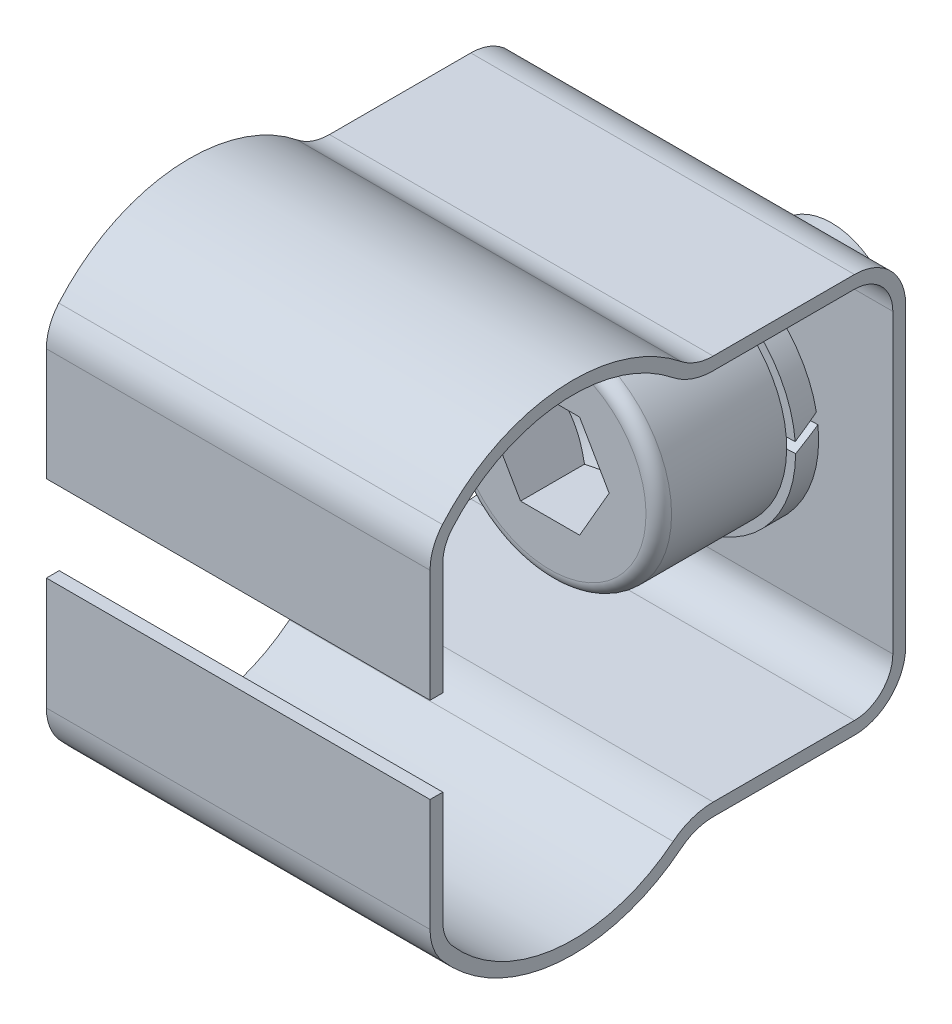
ISO-10303-21;
HEADER;
FILE_DESCRIPTION(('STEP AP214'),'2;1');
FILE_NAME('part.step','',(''),(''),'','','');
FILE_SCHEMA(('AUTOMOTIVE_DESIGN { 1 0 10303 214 1 1 1 1 }'));
ENDSEC;
DATA;
#1=APPLICATION_CONTEXT('core data for automotive mechanical design processes');
#2=APPLICATION_PROTOCOL_DEFINITION('international standard','automotive_design',2000,#1);
#3=PRODUCT_CONTEXT('',#1,'mechanical');
#4=PRODUCT('Part','Part','',(#3));
#5=PRODUCT_RELATED_PRODUCT_CATEGORY('part','',(#4));
#6=PRODUCT_DEFINITION_FORMATION('','',#4);
#7=PRODUCT_DEFINITION_CONTEXT('part definition',#1,'design');
#8=PRODUCT_DEFINITION('design','',#6,#7);
#9=PRODUCT_DEFINITION_SHAPE('','',#8);
#10=(LENGTH_UNIT() NAMED_UNIT(*) SI_UNIT(.MILLI.,.METRE.));
#11=(NAMED_UNIT(*) PLANE_ANGLE_UNIT() SI_UNIT($,.RADIAN.));
#12=(NAMED_UNIT(*) SI_UNIT($,.STERADIAN.) SOLID_ANGLE_UNIT());
#13=UNCERTAINTY_MEASURE_WITH_UNIT(LENGTH_MEASURE(1.E-05),#10,'distance_accuracy_value','');
#14=(GEOMETRIC_REPRESENTATION_CONTEXT(3) GLOBAL_UNCERTAINTY_ASSIGNED_CONTEXT((#13)) GLOBAL_UNIT_ASSIGNED_CONTEXT((#10,
#11,#12)) REPRESENTATION_CONTEXT('',''));
#15=CARTESIAN_POINT('',(0.,0.,0.));
#16=DIRECTION('',(0.,0.,1.));
#17=DIRECTION('',(1.,0.,0.));
#18=AXIS2_PLACEMENT_3D('',#15,#16,#17);
#19=CARTESIAN_POINT('',(-5.89805981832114E-13,0.000349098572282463,0.499999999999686));
#20=DIRECTION('',(-1.18030791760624E-12,-2.05001268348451E-12,1.));
#21=DIRECTION('',(0.,-1.,-2.05001268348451E-12));
#22=AXIS2_PLACEMENT_3D('',#19,#20,#21);
#23=PLANE('',#22);
#24=DIRECTION('',(-1.,0.,-1.18030585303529E-12));
#25=VECTOR('',#24,1.);
#26=CARTESIAN_POINT('',(-5.89805981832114E-13,5.80069819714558,0.500000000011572));
#27=LINE('',#26,#25);
#28=CARTESIAN_POINT('',(7.49999999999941,5.80069819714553,0.500000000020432));
#29=VERTEX_POINT('',#28);
#30=CARTESIAN_POINT('',(-7.50000000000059,5.80069819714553,0.50000000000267));
#31=VERTEX_POINT('',#30);
#32=EDGE_CURVE('E343',#29,#31,#27,.T.);
#33=ORIENTED_EDGE('',*,*,#32,.T.);
#34=DIRECTION('',(0.,1.,2.04003480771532E-12));
#35=VECTOR('',#34,1.);
#36=CARTESIAN_POINT('',(-7.50000000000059,-26.6811081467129,0.499999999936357));
#37=LINE('',#36,#35);
#38=CARTESIAN_POINT('',(-7.50000000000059,-5.80000000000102,0.499999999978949));
#39=VERTEX_POINT('',#38);
#40=EDGE_CURVE('E692',#39,#31,#37,.T.);
#41=ORIENTED_EDGE('',*,*,#40,.F.);
#42=DIRECTION('',(1.,0.,1.18030791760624E-12));
#43=VECTOR('',#42,1.);
#44=CARTESIAN_POINT('',(-5.89805981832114E-13,-5.80000000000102,0.499999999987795));
#45=LINE('',#44,#43);
#46=CARTESIAN_POINT('',(7.49999999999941,-5.80000000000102,0.49999999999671));
#47=VERTEX_POINT('',#46);
#48=EDGE_CURVE('E354',#39,#47,#45,.T.);
#49=ORIENTED_EDGE('',*,*,#48,.T.);
#50=DIRECTION('',(0.,1.,2.04003480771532E-12));
#51=VECTOR('',#50,1.);
#52=CARTESIAN_POINT('',(7.49999999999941,26.6818063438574,0.500000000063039));
#53=LINE('',#52,#51);
#54=EDGE_CURVE('E700',#29,#47,#53,.F.);
#55=ORIENTED_EDGE('',*,*,#54,.F.);
#56=EDGE_LOOP('',(#33,#41,#49,#55));
#57=FACE_BOUND('',#56,.T.);
#58=CARTESIAN_POINT('',(-5.89805981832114E-13,-1.02001740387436E-12,0.499999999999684));
#59=DIRECTION('',(1.18030378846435E-12,2.05001268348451E-12,-1.));
#60=DIRECTION('',(0.,1.,2.05001268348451E-12));
#61=AXIS2_PLACEMENT_3D('',#58,#59,#60);
#62=CIRCLE('',#61,2.65);
#63=CARTESIAN_POINT('',(-5.89805981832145E-13,2.64999999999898,0.500000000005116));
#64=VERTEX_POINT('',#63);
#65=EDGE_CURVE('E340',#64,#64,#62,.T.);
#66=ORIENTED_EDGE('',*,*,#65,.T.);
#67=EDGE_LOOP('',(#66));
#68=FACE_BOUND('',#67,.T.);
#69=DIRECTION('',(0.999212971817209,0.0396665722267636,1.26069595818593E-12));
#70=VECTOR('',#69,1.);
#71=CARTESIAN_POINT('',(-0.0285446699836,0.719397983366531,0.500000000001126));
#72=LINE('',#71,#70);
#73=CARTESIAN_POINT('',(2.59951166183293,0.823726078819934,0.500000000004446));
#74=VERTEX_POINT('',#73);
#75=CARTESIAN_POINT('',(4.51124329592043,0.899617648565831,0.500000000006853));
#76=VERTEX_POINT('',#75);
#77=EDGE_CURVE('E9',#74,#76,#72,.T.);
#78=ORIENTED_EDGE('',*,*,#77,.F.);
#79=CARTESIAN_POINT('',(-5.89805981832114E-13,0.000349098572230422,0.499999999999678));
#80=DIRECTION('',(-1.17911742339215E-12,-2.04285925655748E-12,1.));
#81=DIRECTION('',(0.,-1.,-2.04285925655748E-12));
#82=AXIS2_PLACEMENT_3D('',#79,#80,#81);
#83=CIRCLE('',#82,2.72679491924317);
#84=CARTESIAN_POINT('',(2.69318932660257,0.427129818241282,0.500000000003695));
#85=VERTEX_POINT('',#84);
#86=EDGE_CURVE('E23',#74,#85,#83,.T.);
#87=ORIENTED_EDGE('',*,*,#86,.T.);
#88=DIRECTION('',(-0.999212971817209,-0.0396665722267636,-1.26069595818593E-12));
#89=VECTOR('',#88,1.);
#90=CARTESIAN_POINT('',(-0.0126780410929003,0.319712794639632,0.500000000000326));
#91=LINE('',#90,#89);
#92=CARTESIAN_POINT('',(4.57259325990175,0.501738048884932,0.500000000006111));
#93=VERTEX_POINT('',#92);
#94=EDGE_CURVE('E887',#93,#85,#91,.T.);
#95=ORIENTED_EDGE('',*,*,#94,.F.);
#96=CARTESIAN_POINT('',(-5.89805981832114E-13,0.000349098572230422,0.499999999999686));
#97=DIRECTION('',(-1.18030791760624E-12,-2.05001268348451E-12,1.));
#98=DIRECTION('',(0.,-1.,-2.05001268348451E-12));
#99=AXIS2_PLACEMENT_3D('',#96,#97,#98);
#100=CIRCLE('',#99,4.6);
#101=EDGE_CURVE('E405',#93,#76,#100,.F.);
#102=ORIENTED_EDGE('',*,*,#101,.T.);
#103=EDGE_LOOP('',(#78,#87,#95,#102));
#104=FACE_BOUND('',#103,.T.);
#105=ADVANCED_FACE('F14',(#57,#68,#104),#23,.T.);
#106=CARTESIAN_POINT('',(-2.13553133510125E-11,-32.7620988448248,18.0928863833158));
#107=DIRECTION('',(1.18030378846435E-12,2.04827064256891E-12,-1.));
#108=DIRECTION('',(0.,1.,2.04827064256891E-12));
#109=AXIS2_PLACEMENT_3D('',#106,#107,#108);
#110=PLANE('',#109);
#111=DIRECTION('',(-1.,0.,-1.18030585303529E-12));
#112=VECTOR('',#111,1.);
#113=CARTESIAN_POINT('',(-2.13553133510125E-11,-6.08064159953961,18.0928863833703));
#114=LINE('',#113,#112);
#115=CARTESIAN_POINT('',(7.49999999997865,-6.08064159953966,18.0928863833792));
#116=VERTEX_POINT('',#115);
#117=CARTESIAN_POINT('',(-7.50000000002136,-6.08064159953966,18.0928863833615));
#118=VERTEX_POINT('',#117);
#119=EDGE_CURVE('E245',#116,#118,#114,.T.);
#120=ORIENTED_EDGE('',*,*,#119,.T.);
#121=DIRECTION('',(0.,1.,2.04003480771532E-12));
#122=VECTOR('',#121,1.);
#123=CARTESIAN_POINT('',(-7.50000000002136,-6.08064159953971,18.0928863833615));
#124=LINE('',#123,#122);
#125=CARTESIAN_POINT('',(-7.50000000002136,-1.68012598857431,18.0928863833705));
#126=VERTEX_POINT('',#125);
#127=EDGE_CURVE('E255',#126,#118,#124,.F.);
#128=ORIENTED_EDGE('',*,*,#127,.F.);
#129=DIRECTION('',(1.,0.,1.18030585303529E-12));
#130=VECTOR('',#129,1.);
#131=CARTESIAN_POINT('',(-7.50000000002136,-1.68012598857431,18.0928863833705));
#132=LINE('',#131,#130);
#133=CARTESIAN_POINT('',(7.49999999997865,-1.68012598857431,18.0928863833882));
#134=VERTEX_POINT('',#133);
#135=EDGE_CURVE('E268',#134,#126,#132,.F.);
#136=ORIENTED_EDGE('',*,*,#135,.F.);
#137=DIRECTION('',(0.,1.,2.04003480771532E-12));
#138=VECTOR('',#137,1.);
#139=CARTESIAN_POINT('',(7.49999999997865,-59.44355609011,18.0928863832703));
#140=LINE('',#139,#138);
#141=EDGE_CURVE('E258',#116,#134,#140,.T.);
#142=ORIENTED_EDGE('',*,*,#141,.F.);
#143=EDGE_LOOP('',(#120,#128,#136,#142));
#144=FACE_BOUND('',#143,.T.);
#145=ADVANCED_FACE('F16',(#144),#110,.T.);
#146=CARTESIAN_POINT('',(-7.50000000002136,-1.68012598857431,18.0928863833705));
#147=DIRECTION('',(0.,1.,2.04818397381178E-12));
#148=DIRECTION('',(-1.18030585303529E-12,-2.04818397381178E-12,1.));
#149=AXIS2_PLACEMENT_3D('',#146,#147,#148);
#150=PLANE('',#149);
#151=DIRECTION('',(1.,0.,1.18030791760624E-12));
#152=VECTOR('',#151,1.);
#153=CARTESIAN_POINT('',(-2.19451193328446E-11,-1.68012598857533,18.5928863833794));
#154=LINE('',#153,#152);
#155=CARTESIAN_POINT('',(-7.50000000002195,-1.68012598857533,18.5928863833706));
#156=VERTEX_POINT('',#155);
#157=CARTESIAN_POINT('',(7.49999999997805,-1.68012598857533,18.5928863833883));
#158=VERTEX_POINT('',#157);
#159=EDGE_CURVE('E252',#156,#158,#154,.T.);
#160=ORIENTED_EDGE('',*,*,#159,.T.);
#161=DIRECTION('',(-1.18030585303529E-12,-2.04818397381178E-12,1.));
#162=VECTOR('',#161,1.);
#163=CARTESIAN_POINT('',(7.49999999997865,-1.68012598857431,18.0928863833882));
#164=LINE('',#163,#162);
#165=EDGE_CURVE('E261',#158,#134,#164,.F.);
#166=ORIENTED_EDGE('',*,*,#165,.T.);
#167=ORIENTED_EDGE('',*,*,#135,.T.);
#168=DIRECTION('',(-1.18030585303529E-12,-2.04818397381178E-12,1.));
#169=VECTOR('',#168,1.);
#170=CARTESIAN_POINT('',(-7.50000000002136,-1.68012598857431,18.0928863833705));
#171=LINE('',#170,#169);
#172=EDGE_CURVE('E266',#126,#156,#171,.T.);
#173=ORIENTED_EDGE('',*,*,#172,.T.);
#174=EDGE_LOOP('',(#160,#166,#167,#173));
#175=FACE_BOUND('',#174,.T.);
#176=ADVANCED_FACE('F745',(#175),#150,.T.);
#177=CARTESIAN_POINT('',(-1.95850280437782E-11,-6.08064159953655,16.5928863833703));
#178=DIRECTION('',(-1.,0.,-1.18030585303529E-12));
#179=DIRECTION('',(-1.18030585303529E-12,-2.04003480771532E-12,1.));
#180=AXIS2_PLACEMENT_3D('',#177,#178,#179);
#181=CYLINDRICAL_SURFACE('',#180,1.5);
#182=CARTESIAN_POINT('',(7.49999999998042,-6.08064159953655,16.5928863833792));
#183=DIRECTION('',(-1.,0.,-1.18030585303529E-12));
#184=DIRECTION('',(-1.18030585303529E-12,-2.04003480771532E-12,1.));
#185=AXIS2_PLACEMENT_3D('',#182,#183,#184);
#186=CIRCLE('',#185,1.5);
#187=CARTESIAN_POINT('',(7.49999999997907,-7.05986290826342,17.729163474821));
#188=VERTEX_POINT('',#187);
#189=EDGE_CURVE('E251',#188,#116,#186,.T.);
#190=ORIENTED_EDGE('',*,*,#189,.F.);
#191=DIRECTION('',(-1.,0.,-1.18030585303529E-12));
#192=VECTOR('',#191,1.);
#193=CARTESIAN_POINT('',(-2.09259692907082E-11,-7.05986290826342,17.7291634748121));
#194=LINE('',#193,#192);
#195=CARTESIAN_POINT('',(-7.50000000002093,-7.05986290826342,17.7291634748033));
#196=VERTEX_POINT('',#195);
#197=EDGE_CURVE('E247',#188,#196,#194,.T.);
#198=ORIENTED_EDGE('',*,*,#197,.T.);
#199=CARTESIAN_POINT('',(-7.50000000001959,-6.08064159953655,16.5928863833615));
#200=DIRECTION('',(-1.,0.,-1.18030585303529E-12));
#201=DIRECTION('',(-1.18030585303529E-12,-2.04003480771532E-12,1.));
#202=AXIS2_PLACEMENT_3D('',#199,#200,#201);
#203=CIRCLE('',#202,1.5);
#204=EDGE_CURVE('E242',#118,#196,#203,.F.);
#205=ORIENTED_EDGE('',*,*,#204,.F.);
#206=ORIENTED_EDGE('',*,*,#119,.F.);
#207=EDGE_LOOP('',(#190,#198,#205,#206));
#208=FACE_BOUND('',#207,.T.);
#209=ADVANCED_FACE('F244',(#208),#181,.F.);
#210=CARTESIAN_POINT('',(-2.19451193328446E-11,-32.7620988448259,18.5928863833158));
#211=DIRECTION('',(1.18030791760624E-12,2.04827064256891E-12,-1.));
#212=DIRECTION('',(0.,1.,2.04827064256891E-12));
#213=AXIS2_PLACEMENT_3D('',#210,#211,#212);
#214=PLANE('',#213);
#215=DIRECTION('',(0.,1.,2.04827064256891E-12));
#216=VECTOR('',#215,1.);
#217=CARTESIAN_POINT('',(-7.50000000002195,-32.7620988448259,18.5928863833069));
#218=LINE('',#217,#216);
#219=CARTESIAN_POINT('',(-7.50000000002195,-6.08064159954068,18.5928863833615));
#220=VERTEX_POINT('',#219);
#221=EDGE_CURVE('E726',#220,#156,#218,.T.);
#222=ORIENTED_EDGE('',*,*,#221,.F.);
#223=DIRECTION('',(-1.,0.,-1.18030585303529E-12));
#224=VECTOR('',#223,1.);
#225=CARTESIAN_POINT('',(-2.19451193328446E-11,-6.08064159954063,18.5928863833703));
#226=LINE('',#225,#224);
#227=CARTESIAN_POINT('',(7.49999999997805,-6.08064159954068,18.5928863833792));
#228=VERTEX_POINT('',#227);
#229=EDGE_CURVE('E390',#228,#220,#226,.T.);
#230=ORIENTED_EDGE('',*,*,#229,.F.);
#231=DIRECTION('',(0.,1.,2.04827064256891E-12));
#232=VECTOR('',#231,1.);
#233=CARTESIAN_POINT('',(7.49999999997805,-32.7620988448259,18.5928863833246));
#234=LINE('',#233,#232);
#235=EDGE_CURVE('E260',#158,#228,#234,.F.);
#236=ORIENTED_EDGE('',*,*,#235,.F.);
#237=ORIENTED_EDGE('',*,*,#159,.F.);
#238=EDGE_LOOP('',(#222,#230,#236,#237));
#239=FACE_BOUND('',#238,.T.);
#240=ADVANCED_FACE('F1338',(#239),#214,.F.);
#241=CARTESIAN_POINT('',(-1.53436291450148E-11,-2.98436259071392,12.9999999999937));
#242=DIRECTION('',(-1.,0.,-1.18030585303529E-12));
#243=DIRECTION('',(-1.18030585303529E-12,-2.04003480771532E-12,1.));
#244=AXIS2_PLACEMENT_3D('',#241,#242,#243);
#245=CYLINDRICAL_SURFACE('',#244,6.2429712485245);
#246=CARTESIAN_POINT('',(7.49999999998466,-2.98436259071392,13.0000000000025));
#247=DIRECTION('',(-1.,0.,-1.18030585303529E-12));
#248=DIRECTION('',(-1.18030585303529E-12,-2.04003480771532E-12,1.));
#249=AXIS2_PLACEMENT_3D('',#246,#247,#248);
#250=CIRCLE('',#249,6.2429712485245);
#251=CARTESIAN_POINT('',(7.49999999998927,-7.85110950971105,9.08982552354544));
#252=VERTEX_POINT('',#251);
#253=EDGE_CURVE('E380',#252,#188,#250,.T.);
#254=ORIENTED_EDGE('',*,*,#253,.F.);
#255=DIRECTION('',(1.,0.,1.18030585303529E-12));
#256=VECTOR('',#255,1.);
#257=CARTESIAN_POINT('',(-1.07283973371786E-11,-7.85110950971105,9.08982552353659));
#258=LINE('',#257,#256);
#259=CARTESIAN_POINT('',(-7.50000000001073,-7.85110950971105,9.08982552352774));
#260=VERTEX_POINT('',#259);
#261=EDGE_CURVE('E379',#260,#252,#258,.T.);
#262=ORIENTED_EDGE('',*,*,#261,.F.);
#263=CARTESIAN_POINT('',(-7.50000000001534,-2.98436259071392,12.9999999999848));
#264=DIRECTION('',(-1.,0.,-1.18030585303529E-12));
#265=DIRECTION('',(-1.18030585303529E-12,-2.04003480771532E-12,1.));
#266=AXIS2_PLACEMENT_3D('',#263,#264,#265);
#267=CIRCLE('',#266,6.2429712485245);
#268=EDGE_CURVE('E383',#196,#260,#267,.F.);
#269=ORIENTED_EDGE('',*,*,#268,.F.);
#270=ORIENTED_EDGE('',*,*,#197,.F.);
#271=EDGE_LOOP('',(#254,#262,#269,#270));
#272=FACE_BOUND('',#271,.T.);
#273=ADVANCED_FACE('F754',(#272),#245,.F.);
#274=CARTESIAN_POINT('',(-1.95850280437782E-11,-6.08064159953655,16.5928863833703));
#275=DIRECTION('',(-1.,0.,-1.18030585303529E-12));
#276=DIRECTION('',(-1.18030585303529E-12,-2.04003480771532E-12,1.));
#277=AXIS2_PLACEMENT_3D('',#274,#275,#276);
#278=CYLINDRICAL_SURFACE('',#277,2.);
#279=DIRECTION('',(-1.,0.,-1.18030585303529E-12));
#280=VECTOR('',#279,1.);
#281=CARTESIAN_POINT('',(-2.13726605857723E-11,-7.38627001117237,18.1079225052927));
#282=LINE('',#281,#280);
#283=CARTESIAN_POINT('',(7.49999999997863,-7.38627001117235,18.1079225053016));
#284=VERTEX_POINT('',#283);
#285=CARTESIAN_POINT('',(-7.50000000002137,-7.38627001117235,18.1079225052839));
#286=VERTEX_POINT('',#285);
#287=EDGE_CURVE('E372',#284,#286,#282,.T.);
#288=ORIENTED_EDGE('',*,*,#287,.F.);
#289=CARTESIAN_POINT('',(7.49999999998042,-6.08064159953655,16.5928863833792));
#290=DIRECTION('',(-1.,0.,-1.18030585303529E-12));
#291=DIRECTION('',(-1.18030585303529E-12,-2.04003480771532E-12,1.));
#292=AXIS2_PLACEMENT_3D('',#289,#290,#291);
#293=CIRCLE('',#292,2.);
#294=EDGE_CURVE('E385',#284,#228,#293,.T.);
#295=ORIENTED_EDGE('',*,*,#294,.T.);
#296=ORIENTED_EDGE('',*,*,#229,.T.);
#297=CARTESIAN_POINT('',(-7.50000000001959,-6.08064159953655,16.5928863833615));
#298=DIRECTION('',(-1.,0.,-1.18030585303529E-12));
#299=DIRECTION('',(-1.18030585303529E-12,-2.04003480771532E-12,1.));
#300=AXIS2_PLACEMENT_3D('',#297,#298,#299);
#301=CIRCLE('',#300,2.);
#302=EDGE_CURVE('E388',#220,#286,#301,.F.);
#303=ORIENTED_EDGE('',*,*,#302,.T.);
#304=EDGE_LOOP('',(#288,#295,#296,#303));
#305=FACE_BOUND('',#304,.T.);
#306=ADVANCED_FACE('F1320',(#305),#278,.T.);
#307=CARTESIAN_POINT('',(-8.88091683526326E-12,-9.80000000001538,7.5239947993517));
#308=DIRECTION('',(1.,0.,1.18030585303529E-12));
#309=DIRECTION('',(1.18030585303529E-12,2.04003480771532E-12,-1.));
#310=AXIS2_PLACEMENT_3D('',#307,#308,#309);
#311=CYLINDRICAL_SURFACE('',#310,2.5);
#312=DIRECTION('',(1.,0.,1.18030585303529E-12));
#313=VECTOR('',#312,1.);
#314=CARTESIAN_POINT('',(-8.88091683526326E-12,-7.3000000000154,7.52399479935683));
#315=LINE('',#314,#313);
#316=CARTESIAN_POINT('',(-7.50000000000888,-7.30000000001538,7.52399479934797));
#317=VERTEX_POINT('',#316);
#318=CARTESIAN_POINT('',(7.49999999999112,-7.30000000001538,7.52399479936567));
#319=VERTEX_POINT('',#318);
#320=EDGE_CURVE('E368',#317,#319,#315,.T.);
#321=ORIENTED_EDGE('',*,*,#320,.F.);
#322=CARTESIAN_POINT('',(-7.50000000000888,-9.80000000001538,7.52399479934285));
#323=DIRECTION('',(1.,0.,1.18030585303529E-12));
#324=DIRECTION('',(1.18030585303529E-12,2.04003480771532E-12,-1.));
#325=AXIS2_PLACEMENT_3D('',#322,#323,#324);
#326=CIRCLE('',#325,2.5);
#327=EDGE_CURVE('E373',#260,#317,#326,.F.);
#328=ORIENTED_EDGE('',*,*,#327,.F.);
#329=ORIENTED_EDGE('',*,*,#261,.T.);
#330=CARTESIAN_POINT('',(7.49999999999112,-9.80000000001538,7.52399479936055));
#331=DIRECTION('',(1.,0.,1.18030585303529E-12));
#332=DIRECTION('',(1.18030585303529E-12,2.04003480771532E-12,-1.));
#333=AXIS2_PLACEMENT_3D('',#330,#331,#332);
#334=CIRCLE('',#333,2.5);
#335=EDGE_CURVE('E376',#319,#252,#334,.T.);
#336=ORIENTED_EDGE('',*,*,#335,.F.);
#337=EDGE_LOOP('',(#321,#328,#329,#336));
#338=FACE_BOUND('',#337,.T.);
#339=ADVANCED_FACE('F758',(#338),#311,.T.);
#340=CARTESIAN_POINT('',(-1.53436291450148E-11,-2.98436259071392,12.9999999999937));
#341=DIRECTION('',(-1.,0.,-1.18030585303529E-12));
#342=DIRECTION('',(-1.18030585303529E-12,-2.04003480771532E-12,1.));
#343=AXIS2_PLACEMENT_3D('',#340,#341,#342);
#344=CYLINDRICAL_SURFACE('',#343,6.7429712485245);
#345=DIRECTION('',(1.,0.,1.18030585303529E-12));
#346=VECTOR('',#345,1.);
#347=CARTESIAN_POINT('',(-1.03589012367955E-11,-8.24088760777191,8.77665937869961));
#348=LINE('',#347,#346);
#349=CARTESIAN_POINT('',(-7.50000000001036,-8.24088760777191,8.77665937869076));
#350=VERTEX_POINT('',#349);
#351=CARTESIAN_POINT('',(7.49999999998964,-8.24088760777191,8.77665937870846));
#352=VERTEX_POINT('',#351);
#353=EDGE_CURVE('E361',#350,#352,#348,.T.);
#354=ORIENTED_EDGE('',*,*,#353,.T.);
#355=CARTESIAN_POINT('',(7.49999999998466,-2.98436259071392,13.0000000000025));
#356=DIRECTION('',(-1.,0.,-1.18030585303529E-12));
#357=DIRECTION('',(-1.18030585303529E-12,-2.04003480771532E-12,1.));
#358=AXIS2_PLACEMENT_3D('',#355,#356,#357);
#359=CIRCLE('',#358,6.7429712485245);
#360=EDGE_CURVE('E365',#352,#284,#359,.T.);
#361=ORIENTED_EDGE('',*,*,#360,.T.);
#362=ORIENTED_EDGE('',*,*,#287,.T.);
#363=CARTESIAN_POINT('',(-7.50000000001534,-2.98436259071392,12.9999999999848));
#364=DIRECTION('',(-1.,0.,-1.18030585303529E-12));
#365=DIRECTION('',(-1.18030585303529E-12,-2.04003480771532E-12,1.));
#366=AXIS2_PLACEMENT_3D('',#363,#364,#365);
#367=CIRCLE('',#366,6.7429712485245);
#368=EDGE_CURVE('E369',#286,#350,#367,.F.);
#369=ORIENTED_EDGE('',*,*,#368,.T.);
#370=EDGE_LOOP('',(#354,#361,#362,#369));
#371=FACE_BOUND('',#370,.T.);
#372=ADVANCED_FACE('F1302',(#371),#344,.T.);
#373=CARTESIAN_POINT('',(7.6744166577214E-12,-7.29999999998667,-6.50211878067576));
#374=DIRECTION('',(0.,1.,2.04829755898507E-12));
#375=DIRECTION('',(-1.18030585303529E-12,-2.04829755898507E-12,1.));
#376=AXIS2_PLACEMENT_3D('',#373,#374,#375);
#377=PLANE('',#376);
#378=DIRECTION('',(-1.,0.,-1.18030585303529E-12));
#379=VECTOR('',#378,1.);
#380=CARTESIAN_POINT('',(-2.36095865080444E-12,-7.30000000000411,1.99999999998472));
#381=LINE('',#380,#379);
#382=CARTESIAN_POINT('',(7.49999999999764,-7.30000000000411,1.99999999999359));
#383=VERTEX_POINT('',#382);
#384=CARTESIAN_POINT('',(-7.50000000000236,-7.30000000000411,1.99999999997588));
#385=VERTEX_POINT('',#384);
#386=EDGE_CURVE('E696',#383,#385,#381,.T.);
#387=ORIENTED_EDGE('',*,*,#386,.T.);
#388=DIRECTION('',(-1.18030585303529E-12,-2.04003480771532E-12,1.));
#389=VECTOR('',#388,1.);
#390=CARTESIAN_POINT('',(-7.50000000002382,-7.3000000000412,20.1793384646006));
#391=LINE('',#390,#389);
#392=EDGE_CURVE('E364',#317,#385,#391,.F.);
#393=ORIENTED_EDGE('',*,*,#392,.F.);
#394=ORIENTED_EDGE('',*,*,#320,.T.);
#395=DIRECTION('',(1.18030585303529E-12,2.04003480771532E-12,-1.));
#396=VECTOR('',#395,1.);
#397=CARTESIAN_POINT('',(7.50000000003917,-7.29999999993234,-33.183576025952));
#398=LINE('',#397,#396);
#399=EDGE_CURVE('E713',#383,#319,#398,.F.);
#400=ORIENTED_EDGE('',*,*,#399,.F.);
#401=EDGE_LOOP('',(#387,#393,#394,#400));
#402=FACE_BOUND('',#401,.T.);
#403=ADVANCED_FACE('F760',(#402),#377,.T.);
#404=CARTESIAN_POINT('',(-8.88091683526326E-12,-9.80000000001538,7.5239947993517));
#405=DIRECTION('',(1.,0.,1.18030585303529E-12));
#406=DIRECTION('',(1.18030585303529E-12,2.04003480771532E-12,-1.));
#407=AXIS2_PLACEMENT_3D('',#404,#405,#406);
#408=CYLINDRICAL_SURFACE('',#407,2.);
#409=CARTESIAN_POINT('',(-7.50000000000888,-9.80000000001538,7.52399479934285));
#410=DIRECTION('',(1.,0.,1.18030585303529E-12));
#411=DIRECTION('',(1.18030585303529E-12,2.04003480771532E-12,-1.));
#412=AXIS2_PLACEMENT_3D('',#409,#410,#411);
#413=CIRCLE('',#412,2.);
#414=CARTESIAN_POINT('',(-7.50000000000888,-7.80000000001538,7.52399479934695));
#415=VERTEX_POINT('',#414);
#416=EDGE_CURVE('E359',#415,#350,#413,.T.);
#417=ORIENTED_EDGE('',*,*,#416,.F.);
#418=DIRECTION('',(1.,0.,1.18030585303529E-12));
#419=VECTOR('',#418,1.);
#420=CARTESIAN_POINT('',(-8.88091683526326E-12,-7.80000000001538,7.5239947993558));
#421=LINE('',#420,#419);
#422=CARTESIAN_POINT('',(7.49999999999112,-7.80000000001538,7.52399479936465));
#423=VERTEX_POINT('',#422);
#424=EDGE_CURVE('E358',#415,#423,#421,.T.);
#425=ORIENTED_EDGE('',*,*,#424,.T.);
#426=CARTESIAN_POINT('',(7.49999999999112,-9.80000000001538,7.52399479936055));
#427=DIRECTION('',(1.,0.,1.18030585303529E-12));
#428=DIRECTION('',(1.18030585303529E-12,2.04003480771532E-12,-1.));
#429=AXIS2_PLACEMENT_3D('',#426,#427,#428);
#430=CIRCLE('',#429,2.);
#431=EDGE_CURVE('E362',#352,#423,#430,.F.);
#432=ORIENTED_EDGE('',*,*,#431,.F.);
#433=ORIENTED_EDGE('',*,*,#353,.F.);
#434=EDGE_LOOP('',(#417,#425,#432,#433));
#435=FACE_BOUND('',#434,.T.);
#436=ADVANCED_FACE('F1284',(#435),#408,.F.);
#437=CARTESIAN_POINT('',(-2.36095865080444E-12,-5.80000000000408,1.99999999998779));
#438=DIRECTION('',(-1.,0.,-1.18030585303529E-12));
#439=DIRECTION('',(-1.18030585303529E-12,-2.04003480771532E-12,1.));
#440=AXIS2_PLACEMENT_3D('',#437,#438,#439);
#441=CYLINDRICAL_SURFACE('',#440,1.5);
#442=CARTESIAN_POINT('',(7.49999999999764,-5.80000000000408,1.99999999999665));
#443=DIRECTION('',(-1.,0.,-1.18030585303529E-12));
#444=DIRECTION('',(-1.18030585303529E-12,-2.04003480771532E-12,1.));
#445=AXIS2_PLACEMENT_3D('',#442,#443,#444);
#446=CIRCLE('',#445,1.5);
#447=EDGE_CURVE('E351',#47,#383,#446,.T.);
#448=ORIENTED_EDGE('',*,*,#447,.F.);
#449=ORIENTED_EDGE('',*,*,#48,.F.);
#450=CARTESIAN_POINT('',(-7.50000000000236,-5.80000000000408,1.99999999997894));
#451=DIRECTION('',(-1.,0.,-1.18030585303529E-12));
#452=DIRECTION('',(-1.18030585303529E-12,-2.04003480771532E-12,1.));
#453=AXIS2_PLACEMENT_3D('',#450,#451,#452);
#454=CIRCLE('',#453,1.5);
#455=EDGE_CURVE('E355',#385,#39,#454,.F.);
#456=ORIENTED_EDGE('',*,*,#455,.F.);
#457=ORIENTED_EDGE('',*,*,#386,.F.);
#458=EDGE_LOOP('',(#448,#449,#456,#457));
#459=FACE_BOUND('',#458,.T.);
#460=ADVANCED_FACE('F763',(#459),#441,.F.);
#461=CARTESIAN_POINT('',(7.6744166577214E-12,-7.79999999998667,-6.50211878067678));
#462=DIRECTION('',(0.,1.,2.04829755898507E-12));
#463=DIRECTION('',(-1.18030585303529E-12,-2.04829755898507E-12,1.));
#464=AXIS2_PLACEMENT_3D('',#461,#462,#463);
#465=PLANE('',#464);
#466=DIRECTION('',(-1.18030585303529E-12,-2.04829755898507E-12,1.));
#467=VECTOR('',#466,1.);
#468=CARTESIAN_POINT('',(-7.49999999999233,-7.79999999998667,-6.50211878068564));
#469=LINE('',#468,#467);
#470=CARTESIAN_POINT('',(-7.50000000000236,-7.80000000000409,1.99999999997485));
#471=VERTEX_POINT('',#470);
#472=EDGE_CURVE('E695',#471,#415,#469,.T.);
#473=ORIENTED_EDGE('',*,*,#472,.F.);
#474=DIRECTION('',(-1.,0.,-1.18030585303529E-12));
#475=VECTOR('',#474,1.);
#476=CARTESIAN_POINT('',(-2.36095865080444E-12,-7.80000000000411,1.9999999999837));
#477=LINE('',#476,#475);
#478=CARTESIAN_POINT('',(7.49999999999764,-7.80000000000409,1.99999999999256));
#479=VERTEX_POINT('',#478);
#480=EDGE_CURVE('E350',#479,#471,#477,.T.);
#481=ORIENTED_EDGE('',*,*,#480,.F.);
#482=DIRECTION('',(-1.18030585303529E-12,-2.04829755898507E-12,1.));
#483=VECTOR('',#482,1.);
#484=CARTESIAN_POINT('',(7.50000000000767,-7.79999999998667,-6.50211878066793));
#485=LINE('',#484,#483);
#486=EDGE_CURVE('E693',#423,#479,#485,.F.);
#487=ORIENTED_EDGE('',*,*,#486,.F.);
#488=ORIENTED_EDGE('',*,*,#424,.F.);
#489=EDGE_LOOP('',(#473,#481,#487,#488));
#490=FACE_BOUND('',#489,.T.);
#491=ADVANCED_FACE('F1266',(#490),#465,.F.);
#492=CARTESIAN_POINT('',(-2.36095865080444E-12,-5.80000000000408,1.99999999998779));
#493=DIRECTION('',(-1.,0.,-1.18030585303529E-12));
#494=DIRECTION('',(-1.18030585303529E-12,-2.04003480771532E-12,1.));
#495=AXIS2_PLACEMENT_3D('',#492,#493,#494);
#496=CYLINDRICAL_SURFACE('',#495,2.);
#497=DIRECTION('',(1.,0.,1.18030378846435E-12));
#498=VECTOR('',#497,1.);
#499=CARTESIAN_POINT('',(0.,-5.8,-1.22053240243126E-11));
#500=LINE('',#499,#498);
#501=CARTESIAN_POINT('',(-7.5,-5.8,-2.10569712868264E-11));
#502=VERTEX_POINT('',#501);
#503=CARTESIAN_POINT('',(7.5,-5.8,-3.35238349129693E-12));
#504=VERTEX_POINT('',#503);
#505=EDGE_CURVE('E339',#502,#504,#500,.T.);
#506=ORIENTED_EDGE('',*,*,#505,.T.);
#507=CARTESIAN_POINT('',(7.49999999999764,-5.80000000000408,1.99999999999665));
#508=DIRECTION('',(-1.,0.,-1.18030585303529E-12));
#509=DIRECTION('',(-1.18030585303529E-12,-2.04003480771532E-12,1.));
#510=AXIS2_PLACEMENT_3D('',#507,#508,#509);
#511=CIRCLE('',#510,2.);
#512=EDGE_CURVE('E344',#504,#479,#511,.T.);
#513=ORIENTED_EDGE('',*,*,#512,.T.);
#514=ORIENTED_EDGE('',*,*,#480,.T.);
#515=CARTESIAN_POINT('',(-7.50000000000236,-5.80000000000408,1.99999999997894));
#516=DIRECTION('',(-1.,0.,-1.18030585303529E-12));
#517=DIRECTION('',(-1.18030585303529E-12,-2.04003480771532E-12,1.));
#518=AXIS2_PLACEMENT_3D('',#515,#516,#517);
#519=CIRCLE('',#518,2.);
#520=EDGE_CURVE('E347',#471,#502,#519,.F.);
#521=ORIENTED_EDGE('',*,*,#520,.T.);
#522=EDGE_LOOP('',(#506,#513,#514,#521));
#523=FACE_BOUND('',#522,.T.);
#524=ADVANCED_FACE('F820',(#523),#496,.T.);
#525=CARTESIAN_POINT('',(-3.63641408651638E-11,-6.31508734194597E-11,30.8091980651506));
#526=DIRECTION('',(1.18030378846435E-12,2.05001268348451E-12,-1.));
#527=DIRECTION('',(0.,1.,2.05001268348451E-12));
#528=AXIS2_PLACEMENT_3D('',#525,#526,#527);
#529=CYLINDRICAL_SURFACE('',#528,2.65);
#530=ORIENTED_EDGE('',*,*,#65,.F.);
#531=EDGE_LOOP('',(#530));
#532=FACE_BOUND('',#531,.T.);
#533=CARTESIAN_POINT('',(0.,0.,-3.1566331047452E-13));
#534=DIRECTION('',(1.18030378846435E-12,2.05001268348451E-12,-1.));
#535=DIRECTION('',(0.,1.,2.05001268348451E-12));
#536=AXIS2_PLACEMENT_3D('',#533,#534,#535);
#537=CIRCLE('',#536,2.65);
#538=CARTESIAN_POINT('',(0.,2.65,5.11687030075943E-12));
#539=VERTEX_POINT('',#538);
#540=EDGE_CURVE('E336',#539,#539,#537,.T.);
#541=ORIENTED_EDGE('',*,*,#540,.T.);
#542=EDGE_LOOP('',(#541));
#543=FACE_BOUND('',#542,.T.);
#544=ADVANCED_FACE('F832',(#532,#543),#529,.F.);
#545=CARTESIAN_POINT('',(-2.36095865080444E-12,5.80069819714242,2.00000000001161));
#546=DIRECTION('',(-1.,0.,-1.18030585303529E-12));
#547=DIRECTION('',(-1.18030585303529E-12,-2.04003480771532E-12,1.));
#548=AXIS2_PLACEMENT_3D('',#545,#546,#547);
#549=CYLINDRICAL_SURFACE('',#548,1.5);
#550=CARTESIAN_POINT('',(7.49999999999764,5.80069819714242,2.00000000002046));
#551=DIRECTION('',(-1.,0.,-1.18030585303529E-12));
#552=DIRECTION('',(-1.18030585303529E-12,-2.04003480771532E-12,1.));
#553=AXIS2_PLACEMENT_3D('',#550,#551,#552);
#554=CIRCLE('',#553,1.5);
#555=CARTESIAN_POINT('',(7.49999999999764,7.30069819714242,2.00000000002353));
#556=VERTEX_POINT('',#555);
#557=EDGE_CURVE('E329',#556,#29,#554,.T.);
#558=ORIENTED_EDGE('',*,*,#557,.F.);
#559=DIRECTION('',(1.,0.,1.18030585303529E-12));
#560=VECTOR('',#559,1.);
#561=CARTESIAN_POINT('',(-2.36095865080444E-12,7.30069819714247,2.00000000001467));
#562=LINE('',#561,#560);
#563=CARTESIAN_POINT('',(-7.50000000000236,7.30069819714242,2.00000000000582));
#564=VERTEX_POINT('',#563);
#565=EDGE_CURVE('E332',#564,#556,#562,.T.);
#566=ORIENTED_EDGE('',*,*,#565,.F.);
#567=CARTESIAN_POINT('',(-7.50000000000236,5.80069819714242,2.00000000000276));
#568=DIRECTION('',(-1.,0.,-1.18030585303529E-12));
#569=DIRECTION('',(-1.18030585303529E-12,-2.04003480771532E-12,1.));
#570=AXIS2_PLACEMENT_3D('',#567,#568,#569);
#571=CIRCLE('',#570,1.5);
#572=EDGE_CURVE('E333',#31,#564,#571,.F.);
#573=ORIENTED_EDGE('',*,*,#572,.F.);
#574=ORIENTED_EDGE('',*,*,#32,.F.);
#575=EDGE_LOOP('',(#558,#566,#573,#574));
#576=FACE_BOUND('',#575,.T.);
#577=ADVANCED_FACE('F769',(#576),#549,.F.);
#578=CARTESIAN_POINT('',(0.,0.000349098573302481,-3.14534803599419E-13));
#579=DIRECTION('',(-1.18030378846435E-12,-2.05001268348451E-12,1.));
#580=DIRECTION('',(0.,-1.,-2.05001268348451E-12));
#581=AXIS2_PLACEMENT_3D('',#578,#579,#580);
#582=PLANE('',#581);
#583=ORIENTED_EDGE('',*,*,#540,.F.);
#584=EDGE_LOOP('',(#583));
#585=FACE_BOUND('',#584,.T.);
#586=DIRECTION('',(0.,-1.,-2.05001268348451E-12));
#587=VECTOR('',#586,1.);
#588=CARTESIAN_POINT('',(-7.5,0.000349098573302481,-9.16681321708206E-12));
#589=LINE('',#588,#587);
#590=CARTESIAN_POINT('',(-7.5,5.80069819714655,2.72161385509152E-12));
#591=VERTEX_POINT('',#590);
#592=EDGE_CURVE('E682',#591,#502,#589,.T.);
#593=ORIENTED_EDGE('',*,*,#592,.F.);
#594=DIRECTION('',(-1.,0.,-1.18030585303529E-12));
#595=VECTOR('',#594,1.);
#596=CARTESIAN_POINT('',(0.,5.8006981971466,1.15717393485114E-11));
#597=LINE('',#596,#595);
#598=CARTESIAN_POINT('',(7.5,5.80069819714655,2.0426201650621E-11));
#599=VERTEX_POINT('',#598);
#600=EDGE_CURVE('E328',#599,#591,#597,.T.);
#601=ORIENTED_EDGE('',*,*,#600,.F.);
#602=DIRECTION('',(0.,-1.,-2.05001268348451E-12));
#603=VECTOR('',#602,1.);
#604=CARTESIAN_POINT('',(7.5,0.000349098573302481,8.53774360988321E-12));
#605=LINE('',#604,#603);
#606=EDGE_CURVE('E680',#504,#599,#605,.F.);
#607=ORIENTED_EDGE('',*,*,#606,.F.);
#608=ORIENTED_EDGE('',*,*,#505,.F.);
#609=EDGE_LOOP('',(#593,#601,#607,#608));
#610=FACE_BOUND('',#609,.T.);
#611=ADVANCED_FACE('F822',(#585,#610),#582,.F.);
#612=CARTESIAN_POINT('',(-2.13553133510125E-11,32.7627970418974,18.0928863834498));
#613=DIRECTION('',(1.18030378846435E-12,2.04012147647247E-12,-1.));
#614=DIRECTION('',(0.,1.,2.04012147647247E-12));
#615=AXIS2_PLACEMENT_3D('',#612,#613,#614);
#616=PLANE('',#615);
#617=DIRECTION('',(-1.,0.,-1.18030585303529E-12));
#618=VECTOR('',#617,1.);
#619=CARTESIAN_POINT('',(-2.13553133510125E-11,6.08133979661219,18.0928863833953));
#620=LINE('',#619,#618);
#621=CARTESIAN_POINT('',(-7.50000000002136,6.08133979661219,18.0928863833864));
#622=VERTEX_POINT('',#621);
#623=CARTESIAN_POINT('',(7.49999999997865,6.08133979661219,18.0928863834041));
#624=VERTEX_POINT('',#623);
#625=EDGE_CURVE('E638',#622,#624,#620,.F.);
#626=ORIENTED_EDGE('',*,*,#625,.T.);
#627=DIRECTION('',(0.,1.,2.04003480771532E-12));
#628=VECTOR('',#627,1.);
#629=CARTESIAN_POINT('',(7.49999999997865,6.08133979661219,18.0928863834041));
#630=LINE('',#629,#628);
#631=CARTESIAN_POINT('',(7.49999999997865,1.68082418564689,18.0928863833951));
#632=VERTEX_POINT('',#631);
#633=EDGE_CURVE('E654',#632,#624,#630,.T.);
#634=ORIENTED_EDGE('',*,*,#633,.F.);
#635=DIRECTION('',(-1.,0.,-1.18030585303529E-12));
#636=VECTOR('',#635,1.);
#637=CARTESIAN_POINT('',(7.49999999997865,1.68082418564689,18.0928863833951));
#638=LINE('',#637,#636);
#639=CARTESIAN_POINT('',(-7.50000000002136,1.68082418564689,18.0928863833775));
#640=VERTEX_POINT('',#639);
#641=EDGE_CURVE('E644',#640,#632,#638,.F.);
#642=ORIENTED_EDGE('',*,*,#641,.F.);
#643=DIRECTION('',(0.,1.,2.04003480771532E-12));
#644=VECTOR('',#643,1.);
#645=CARTESIAN_POINT('',(-7.50000000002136,59.4442542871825,18.0928863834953));
#646=LINE('',#645,#644);
#647=EDGE_CURVE('E324',#622,#640,#646,.F.);
#648=ORIENTED_EDGE('',*,*,#647,.F.);
#649=EDGE_LOOP('',(#626,#634,#642,#648));
#650=FACE_BOUND('',#649,.T.);
#651=ADVANCED_FACE('F785',(#650),#616,.T.);
#652=CARTESIAN_POINT('',(7.6744166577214E-12,7.30069819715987,-6.50211878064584));
#653=DIRECTION('',(0.,-1.,-2.04462238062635E-12));
#654=DIRECTION('',(1.18030585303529E-12,2.04462238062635E-12,-1.));
#655=AXIS2_PLACEMENT_3D('',#652,#653,#654);
#656=PLANE('',#655);
#657=DIRECTION('',(1.,0.,1.18030585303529E-12));
#658=VECTOR('',#657,1.);
#659=CARTESIAN_POINT('',(-8.88091683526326E-12,7.30069819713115,7.52399479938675));
#660=LINE('',#659,#658);
#661=CARTESIAN_POINT('',(-7.50000000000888,7.30069819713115,7.52399479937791));
#662=VERTEX_POINT('',#661);
#663=CARTESIAN_POINT('',(7.49999999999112,7.30069819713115,7.52399479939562));
#664=VERTEX_POINT('',#663);
#665=EDGE_CURVE('E320',#662,#664,#660,.T.);
#666=ORIENTED_EDGE('',*,*,#665,.F.);
#667=DIRECTION('',(-1.18030585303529E-12,-2.04003480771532E-12,1.));
#668=VECTOR('',#667,1.);
#669=CARTESIAN_POINT('',(-7.49999999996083,7.3006981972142,-33.1835760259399));
#670=LINE('',#669,#668);
#671=EDGE_CURVE('E664',#564,#662,#670,.T.);
#672=ORIENTED_EDGE('',*,*,#671,.F.);
#673=ORIENTED_EDGE('',*,*,#565,.T.);
#674=DIRECTION('',(1.18030585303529E-12,2.04003480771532E-12,-1.));
#675=VECTOR('',#674,1.);
#676=CARTESIAN_POINT('',(7.49999999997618,7.30069819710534,20.1793384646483));
#677=LINE('',#676,#675);
#678=EDGE_CURVE('E667',#664,#556,#677,.T.);
#679=ORIENTED_EDGE('',*,*,#678,.F.);
#680=EDGE_LOOP('',(#666,#672,#673,#679));
#681=FACE_BOUND('',#680,.T.);
#682=ADVANCED_FACE('F773',(#681),#656,.T.);
#683=CARTESIAN_POINT('',(-2.36095865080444E-12,5.80069819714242,2.00000000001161));
#684=DIRECTION('',(-1.,0.,-1.18030585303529E-12));
#685=DIRECTION('',(-1.18030585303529E-12,-2.04003480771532E-12,1.));
#686=AXIS2_PLACEMENT_3D('',#683,#684,#685);
#687=CYLINDRICAL_SURFACE('',#686,2.);
#688=DIRECTION('',(1.,0.,1.18030585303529E-12));
#689=VECTOR('',#688,1.);
#690=CARTESIAN_POINT('',(-2.36095865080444E-12,7.80069819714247,2.00000000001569));
#691=LINE('',#690,#689);
#692=CARTESIAN_POINT('',(-7.50000000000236,7.80069819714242,2.00000000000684));
#693=VERTEX_POINT('',#692);
#694=CARTESIAN_POINT('',(7.49999999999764,7.80069819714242,2.00000000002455));
#695=VERTEX_POINT('',#694);
#696=EDGE_CURVE('E312',#693,#695,#691,.T.);
#697=ORIENTED_EDGE('',*,*,#696,.T.);
#698=CARTESIAN_POINT('',(7.49999999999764,5.80069819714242,2.00000000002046));
#699=DIRECTION('',(-1.,0.,-1.18030585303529E-12));
#700=DIRECTION('',(-1.18030585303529E-12,-2.04003480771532E-12,1.));
#701=AXIS2_PLACEMENT_3D('',#698,#699,#700);
#702=CIRCLE('',#701,2.);
#703=EDGE_CURVE('E321',#695,#599,#702,.T.);
#704=ORIENTED_EDGE('',*,*,#703,.T.);
#705=ORIENTED_EDGE('',*,*,#600,.T.);
#706=CARTESIAN_POINT('',(-7.50000000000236,5.80069819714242,2.00000000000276));
#707=DIRECTION('',(-1.,0.,-1.18030585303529E-12));
#708=DIRECTION('',(-1.18030585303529E-12,-2.04003480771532E-12,1.));
#709=AXIS2_PLACEMENT_3D('',#706,#707,#708);
#710=CIRCLE('',#709,2.);
#711=EDGE_CURVE('E325',#591,#693,#710,.F.);
#712=ORIENTED_EDGE('',*,*,#711,.T.);
#713=EDGE_LOOP('',(#697,#704,#705,#712));
#714=FACE_BOUND('',#713,.T.);
#715=ADVANCED_FACE('F815',(#714),#687,.T.);
#716=CARTESIAN_POINT('',(7.49999999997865,1.68082418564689,18.0928863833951));
#717=DIRECTION('',(0.,-1.,-2.04003480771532E-12));
#718=DIRECTION('',(-1.,0.,-1.18030585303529E-12));
#719=AXIS2_PLACEMENT_3D('',#716,#717,#718);
#720=PLANE('',#719);
#721=ORIENTED_EDGE('',*,*,#641,.T.);
#722=DIRECTION('',(1.18030585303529E-12,2.04003480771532E-12,-1.));
#723=VECTOR('',#722,1.);
#724=CARTESIAN_POINT('',(7.49999999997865,1.68082418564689,18.0928863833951));
#725=LINE('',#724,#723);
#726=CARTESIAN_POINT('',(7.49999999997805,1.68082418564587,18.5928863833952));
#727=VERTEX_POINT('',#726);
#728=EDGE_CURVE('E641',#632,#727,#725,.F.);
#729=ORIENTED_EDGE('',*,*,#728,.T.);
#730=DIRECTION('',(1.,0.,1.18030791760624E-12));
#731=VECTOR('',#730,1.);
#732=CARTESIAN_POINT('',(-2.19451193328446E-11,1.68082418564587,18.5928863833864));
#733=LINE('',#732,#731);
#734=CARTESIAN_POINT('',(-7.50000000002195,1.68082418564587,18.5928863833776));
#735=VERTEX_POINT('',#734);
#736=EDGE_CURVE('E307',#727,#735,#733,.F.);
#737=ORIENTED_EDGE('',*,*,#736,.T.);
#738=DIRECTION('',(1.18030585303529E-12,2.04003480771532E-12,-1.));
#739=VECTOR('',#738,1.);
#740=CARTESIAN_POINT('',(-7.50000000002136,1.68082418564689,18.0928863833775));
#741=LINE('',#740,#739);
#742=EDGE_CURVE('E651',#735,#640,#741,.T.);
#743=ORIENTED_EDGE('',*,*,#742,.T.);
#744=EDGE_LOOP('',(#721,#729,#737,#743));
#745=FACE_BOUND('',#744,.T.);
#746=ADVANCED_FACE('F790',(#745),#720,.T.);
#747=CARTESIAN_POINT('',(-1.95850280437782E-11,6.08133979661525,16.5928863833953));
#748=DIRECTION('',(-1.,0.,-1.18030585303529E-12));
#749=DIRECTION('',(-1.18030585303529E-12,-2.04003480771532E-12,1.));
#750=AXIS2_PLACEMENT_3D('',#747,#748,#749);
#751=CYLINDRICAL_SURFACE('',#750,1.5);
#752=CARTESIAN_POINT('',(7.49999999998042,6.08133979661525,16.5928863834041));
#753=DIRECTION('',(-1.,0.,-1.18030585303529E-12));
#754=DIRECTION('',(-1.18030585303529E-12,-2.04003480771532E-12,1.));
#755=AXIS2_PLACEMENT_3D('',#752,#753,#754);
#756=CIRCLE('',#755,1.5);
#757=CARTESIAN_POINT('',(7.49999999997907,7.06056110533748,17.7291634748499));
#758=VERTEX_POINT('',#757);
#759=EDGE_CURVE('E303',#624,#758,#756,.T.);
#760=ORIENTED_EDGE('',*,*,#759,.F.);
#761=ORIENTED_EDGE('',*,*,#625,.F.);
#762=CARTESIAN_POINT('',(-7.50000000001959,6.08133979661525,16.5928863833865));
#763=DIRECTION('',(-1.,0.,-1.18030585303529E-12));
#764=DIRECTION('',(-1.18030585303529E-12,-2.04003480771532E-12,1.));
#765=AXIS2_PLACEMENT_3D('',#762,#763,#764);
#766=CIRCLE('',#765,1.5);
#767=CARTESIAN_POINT('',(-7.50000000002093,7.06056110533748,17.7291634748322));
#768=VERTEX_POINT('',#767);
#769=EDGE_CURVE('E308',#768,#622,#766,.F.);
#770=ORIENTED_EDGE('',*,*,#769,.F.);
#771=DIRECTION('',(-1.,0.,-1.18030585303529E-12));
#772=VECTOR('',#771,1.);
#773=CARTESIAN_POINT('',(-2.09259692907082E-11,7.06056110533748,17.7291634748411));
#774=LINE('',#773,#772);
#775=EDGE_CURVE('E306',#768,#758,#774,.F.);
#776=ORIENTED_EDGE('',*,*,#775,.T.);
#777=EDGE_LOOP('',(#760,#761,#770,#776));
#778=FACE_BOUND('',#777,.T.);
#779=ADVANCED_FACE('F783',(#778),#751,.F.);
#780=CARTESIAN_POINT('',(-8.88091683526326E-12,9.80069819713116,7.52399479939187));
#781=DIRECTION('',(1.,0.,1.18030585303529E-12));
#782=DIRECTION('',(1.18030585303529E-12,2.04003480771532E-12,-1.));
#783=AXIS2_PLACEMENT_3D('',#780,#781,#782);
#784=CYLINDRICAL_SURFACE('',#783,2.5);
#785=DIRECTION('',(-1.,0.,-1.18030585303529E-12));
#786=VECTOR('',#785,1.);
#787=CARTESIAN_POINT('',(-1.07283973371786E-11,7.85180770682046,9.08982552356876));
#788=LINE('',#787,#786);
#789=CARTESIAN_POINT('',(7.49999999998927,7.85180770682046,9.08982552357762));
#790=VERTEX_POINT('',#789);
#791=CARTESIAN_POINT('',(-7.50000000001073,7.85180770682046,9.08982552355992));
#792=VERTEX_POINT('',#791);
#793=EDGE_CURVE('E302',#790,#792,#788,.T.);
#794=ORIENTED_EDGE('',*,*,#793,.T.);
#795=CARTESIAN_POINT('',(-7.50000000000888,9.80069819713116,7.52399479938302));
#796=DIRECTION('',(1.,0.,1.18030585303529E-12));
#797=DIRECTION('',(1.18030585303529E-12,2.04003480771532E-12,-1.));
#798=AXIS2_PLACEMENT_3D('',#795,#796,#797);
#799=CIRCLE('',#798,2.5);
#800=EDGE_CURVE('E313',#662,#792,#799,.F.);
#801=ORIENTED_EDGE('',*,*,#800,.F.);
#802=ORIENTED_EDGE('',*,*,#665,.T.);
#803=CARTESIAN_POINT('',(7.49999999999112,9.80069819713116,7.52399479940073));
#804=DIRECTION('',(1.,0.,1.18030585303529E-12));
#805=DIRECTION('',(1.18030585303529E-12,2.04003480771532E-12,-1.));
#806=AXIS2_PLACEMENT_3D('',#803,#804,#805);
#807=CIRCLE('',#806,2.5);
#808=EDGE_CURVE('E317',#790,#664,#807,.T.);
#809=ORIENTED_EDGE('',*,*,#808,.F.);
#810=EDGE_LOOP('',(#794,#801,#802,#809));
#811=FACE_BOUND('',#810,.T.);
#812=ADVANCED_FACE('F775',(#811),#784,.T.);
#813=CARTESIAN_POINT('',(7.6744166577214E-12,7.80069819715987,-6.50211878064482));
#814=DIRECTION('',(0.,-1.,-2.04462238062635E-12));
#815=DIRECTION('',(1.18030585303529E-12,2.04462238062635E-12,-1.));
#816=AXIS2_PLACEMENT_3D('',#813,#814,#815);
#817=PLANE('',#816);
#818=DIRECTION('',(1.18030585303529E-12,2.04462238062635E-12,-1.));
#819=VECTOR('',#818,1.);
#820=CARTESIAN_POINT('',(-7.49999999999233,7.80069819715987,-6.50211878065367));
#821=LINE('',#820,#819);
#822=CARTESIAN_POINT('',(-7.50000000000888,7.80069819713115,7.52399479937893));
#823=VERTEX_POINT('',#822);
#824=EDGE_CURVE('E633',#823,#693,#821,.T.);
#825=ORIENTED_EDGE('',*,*,#824,.F.);
#826=DIRECTION('',(1.,0.,1.18030585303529E-12));
#827=VECTOR('',#826,1.);
#828=CARTESIAN_POINT('',(-8.88091683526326E-12,7.80069819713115,7.52399479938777));
#829=LINE('',#828,#827);
#830=CARTESIAN_POINT('',(7.49999999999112,7.80069819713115,7.52399479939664));
#831=VERTEX_POINT('',#830);
#832=EDGE_CURVE('E297',#823,#831,#829,.T.);
#833=ORIENTED_EDGE('',*,*,#832,.T.);
#834=DIRECTION('',(1.18030585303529E-12,2.04462238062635E-12,-1.));
#835=VECTOR('',#834,1.);
#836=CARTESIAN_POINT('',(7.50000000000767,7.80069819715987,-6.50211878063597));
#837=LINE('',#836,#835);
#838=EDGE_CURVE('E316',#695,#831,#837,.F.);
#839=ORIENTED_EDGE('',*,*,#838,.F.);
#840=ORIENTED_EDGE('',*,*,#696,.F.);
#841=EDGE_LOOP('',(#825,#833,#839,#840));
#842=FACE_BOUND('',#841,.T.);
#843=ADVANCED_FACE('F808',(#842),#817,.F.);
#844=CARTESIAN_POINT('',(-2.19451193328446E-11,32.7627970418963,18.5928863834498));
#845=DIRECTION('',(1.18030791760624E-12,2.04012147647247E-12,-1.));
#846=DIRECTION('',(0.,1.,2.04012147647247E-12));
#847=AXIS2_PLACEMENT_3D('',#844,#845,#846);
#848=PLANE('',#847);
#849=DIRECTION('',(0.,1.,2.04012147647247E-12));
#850=VECTOR('',#849,1.);
#851=CARTESIAN_POINT('',(7.49999999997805,32.7627970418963,18.5928863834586));
#852=LINE('',#851,#850);
#853=CARTESIAN_POINT('',(7.49999999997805,6.08133979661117,18.5928863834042));
#854=VERTEX_POINT('',#853);
#855=EDGE_CURVE('E626',#854,#727,#852,.F.);
#856=ORIENTED_EDGE('',*,*,#855,.F.);
#857=DIRECTION('',(-1.,0.,-1.18030585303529E-12));
#858=VECTOR('',#857,1.);
#859=CARTESIAN_POINT('',(-2.19451193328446E-11,6.08133979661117,18.5928863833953));
#860=LINE('',#859,#858);
#861=CARTESIAN_POINT('',(-7.50000000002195,6.08133979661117,18.5928863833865));
#862=VERTEX_POINT('',#861);
#863=EDGE_CURVE('E291',#862,#854,#860,.F.);
#864=ORIENTED_EDGE('',*,*,#863,.F.);
#865=DIRECTION('',(0.,1.,2.04012147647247E-12));
#866=VECTOR('',#865,1.);
#867=CARTESIAN_POINT('',(-7.50000000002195,32.7627970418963,18.5928863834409));
#868=LINE('',#867,#866);
#869=EDGE_CURVE('E311',#735,#862,#868,.T.);
#870=ORIENTED_EDGE('',*,*,#869,.F.);
#871=ORIENTED_EDGE('',*,*,#736,.F.);
#872=EDGE_LOOP('',(#856,#864,#870,#871));
#873=FACE_BOUND('',#872,.T.);
#874=ADVANCED_FACE('F796',(#873),#848,.F.);
#875=CARTESIAN_POINT('',(-1.53436291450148E-11,2.98506078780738,13.0000000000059));
#876=DIRECTION('',(-1.,0.,-1.18030585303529E-12));
#877=DIRECTION('',(-1.18030585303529E-12,-2.04003480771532E-12,1.));
#878=AXIS2_PLACEMENT_3D('',#875,#876,#877);
#879=CYLINDRICAL_SURFACE('',#878,6.24297124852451);
#880=CARTESIAN_POINT('',(7.49999999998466,2.98506078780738,13.0000000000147));
#881=DIRECTION('',(-1.,0.,-1.18030585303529E-12));
#882=DIRECTION('',(-1.18030585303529E-12,-2.04003480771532E-12,1.));
#883=AXIS2_PLACEMENT_3D('',#880,#881,#882);
#884=CIRCLE('',#883,6.24297124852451);
#885=EDGE_CURVE('E286',#758,#790,#884,.T.);
#886=ORIENTED_EDGE('',*,*,#885,.F.);
#887=ORIENTED_EDGE('',*,*,#775,.F.);
#888=CARTESIAN_POINT('',(-7.50000000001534,2.98506078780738,12.999999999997));
#889=DIRECTION('',(-1.,0.,-1.18030585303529E-12));
#890=DIRECTION('',(-1.18030585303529E-12,-2.04003480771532E-12,1.));
#891=AXIS2_PLACEMENT_3D('',#888,#889,#890);
#892=CIRCLE('',#891,6.24297124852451);
#893=EDGE_CURVE('E295',#792,#768,#892,.F.);
#894=ORIENTED_EDGE('',*,*,#893,.F.);
#895=ORIENTED_EDGE('',*,*,#793,.F.);
#896=EDGE_LOOP('',(#886,#887,#894,#895));
#897=FACE_BOUND('',#896,.T.);
#898=ADVANCED_FACE('F779',(#897),#879,.F.);
#899=CARTESIAN_POINT('',(-8.88091683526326E-12,9.80069819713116,7.52399479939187));
#900=DIRECTION('',(1.,0.,1.18030585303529E-12));
#901=DIRECTION('',(1.18030585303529E-12,2.04003480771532E-12,-1.));
#902=AXIS2_PLACEMENT_3D('',#899,#900,#901);
#903=CYLINDRICAL_SURFACE('',#902,1.99999999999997);
#904=CARTESIAN_POINT('',(-7.50000000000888,9.80069819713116,7.52399479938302));
#905=DIRECTION('',(1.,0.,1.18030585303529E-12));
#906=DIRECTION('',(1.18030585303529E-12,2.04003480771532E-12,-1.));
#907=AXIS2_PLACEMENT_3D('',#904,#905,#906);
#908=CIRCLE('',#907,1.99999999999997);
#909=CARTESIAN_POINT('',(-7.50000000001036,8.24158580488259,8.77665937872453));
#910=VERTEX_POINT('',#909);
#911=EDGE_CURVE('E298',#910,#823,#908,.T.);
#912=ORIENTED_EDGE('',*,*,#911,.F.);
#913=DIRECTION('',(-1.,0.,-1.18030585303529E-12));
#914=VECTOR('',#913,1.);
#915=CARTESIAN_POINT('',(-1.03589012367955E-11,8.24158580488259,8.77665937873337));
#916=LINE('',#915,#914);
#917=CARTESIAN_POINT('',(7.49999999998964,8.24158580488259,8.77665937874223));
#918=VERTEX_POINT('',#917);
#919=EDGE_CURVE('E285',#918,#910,#916,.T.);
#920=ORIENTED_EDGE('',*,*,#919,.F.);
#921=CARTESIAN_POINT('',(7.49999999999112,9.80069819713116,7.52399479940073));
#922=DIRECTION('',(1.,0.,1.18030585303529E-12));
#923=DIRECTION('',(1.18030585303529E-12,2.04003480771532E-12,-1.));
#924=AXIS2_PLACEMENT_3D('',#921,#922,#923);
#925=CIRCLE('',#924,1.99999999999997);
#926=EDGE_CURVE('E300',#831,#918,#925,.F.);
#927=ORIENTED_EDGE('',*,*,#926,.F.);
#928=ORIENTED_EDGE('',*,*,#832,.F.);
#929=EDGE_LOOP('',(#912,#920,#927,#928));
#930=FACE_BOUND('',#929,.T.);
#931=ADVANCED_FACE('F811',(#930),#903,.F.);
#932=CARTESIAN_POINT('',(-7.50000000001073,7.85180770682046,9.08982552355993));
#933=DIRECTION('',(-1.,0.,-1.18030585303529E-12));
#934=DIRECTION('',(-1.18030585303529E-12,-2.04003480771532E-12,1.));
#935=AXIS2_PLACEMENT_3D('',#932,#933,#934);
#936=PLANE('',#935);
#937=ORIENTED_EDGE('',*,*,#893,.T.);
#938=ORIENTED_EDGE('',*,*,#769,.T.);
#939=ORIENTED_EDGE('',*,*,#647,.T.);
#940=ORIENTED_EDGE('',*,*,#742,.F.);
#941=ORIENTED_EDGE('',*,*,#869,.T.);
#942=CARTESIAN_POINT('',(-7.50000000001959,6.08133979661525,16.5928863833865));
#943=DIRECTION('',(-1.,0.,-1.18030585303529E-12));
#944=DIRECTION('',(-1.18030585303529E-12,-2.04003480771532E-12,1.));
#945=AXIS2_PLACEMENT_3D('',#942,#943,#944);
#946=CIRCLE('',#945,2.);
#947=CARTESIAN_POINT('',(-7.50000000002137,7.38696820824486,18.1079225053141));
#948=VERTEX_POINT('',#947);
#949=EDGE_CURVE('E292',#948,#862,#946,.F.);
#950=ORIENTED_EDGE('',*,*,#949,.F.);
#951=CARTESIAN_POINT('',(-7.50000000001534,2.98506078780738,12.999999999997));
#952=DIRECTION('',(-1.,0.,-1.18030585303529E-12));
#953=DIRECTION('',(-1.18030585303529E-12,-2.04003480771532E-12,1.));
#954=AXIS2_PLACEMENT_3D('',#951,#952,#953);
#955=CIRCLE('',#954,6.74297124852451);
#956=EDGE_CURVE('E282',#910,#948,#955,.F.);
#957=ORIENTED_EDGE('',*,*,#956,.F.);
#958=ORIENTED_EDGE('',*,*,#911,.T.);
#959=ORIENTED_EDGE('',*,*,#824,.T.);
#960=ORIENTED_EDGE('',*,*,#711,.F.);
#961=ORIENTED_EDGE('',*,*,#592,.T.);
#962=ORIENTED_EDGE('',*,*,#520,.F.);
#963=ORIENTED_EDGE('',*,*,#472,.T.);
#964=ORIENTED_EDGE('',*,*,#416,.T.);
#965=ORIENTED_EDGE('',*,*,#368,.F.);
#966=ORIENTED_EDGE('',*,*,#302,.F.);
#967=ORIENTED_EDGE('',*,*,#221,.T.);
#968=ORIENTED_EDGE('',*,*,#172,.F.);
#969=ORIENTED_EDGE('',*,*,#127,.T.);
#970=ORIENTED_EDGE('',*,*,#204,.T.);
#971=ORIENTED_EDGE('',*,*,#268,.T.);
#972=ORIENTED_EDGE('',*,*,#327,.T.);
#973=ORIENTED_EDGE('',*,*,#392,.T.);
#974=ORIENTED_EDGE('',*,*,#455,.T.);
#975=ORIENTED_EDGE('',*,*,#40,.T.);
#976=ORIENTED_EDGE('',*,*,#572,.T.);
#977=ORIENTED_EDGE('',*,*,#671,.T.);
#978=ORIENTED_EDGE('',*,*,#800,.T.);
#979=EDGE_LOOP('',(#937,#938,#939,#940,#941,#950,#957,#958,#959,#960,#961,#962,#963,#964,#965,
#966,#967,#968,#969,#970,#971,#972,#973,#974,#975,#976,#977,#978));
#980=FACE_BOUND('',#979,.T.);
#981=ADVANCED_FACE('F264',(#980),#936,.T.);
#982=CARTESIAN_POINT('',(-1.95850280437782E-11,6.08133979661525,16.5928863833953));
#983=DIRECTION('',(-1.,0.,-1.18030585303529E-12));
#984=DIRECTION('',(-1.18030585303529E-12,-2.04003480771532E-12,1.));
#985=AXIS2_PLACEMENT_3D('',#982,#983,#984);
#986=CYLINDRICAL_SURFACE('',#985,2.);
#987=ORIENTED_EDGE('',*,*,#863,.T.);
#988=CARTESIAN_POINT('',(7.49999999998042,6.08133979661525,16.5928863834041));
#989=DIRECTION('',(-1.,0.,-1.18030585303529E-12));
#990=DIRECTION('',(-1.18030585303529E-12,-2.04003480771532E-12,1.));
#991=AXIS2_PLACEMENT_3D('',#988,#989,#990);
#992=CIRCLE('',#991,2.);
#993=CARTESIAN_POINT('',(7.49999999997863,7.38696820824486,18.1079225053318));
#994=VERTEX_POINT('',#993);
#995=EDGE_CURVE('E289',#854,#994,#992,.T.);
#996=ORIENTED_EDGE('',*,*,#995,.T.);
#997=DIRECTION('',(-1.,0.,-1.18030585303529E-12));
#998=VECTOR('',#997,1.);
#999=CARTESIAN_POINT('',(-2.13726605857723E-11,7.38696820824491,18.107922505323));
#1000=LINE('',#999,#998);
#1001=EDGE_CURVE('E281',#948,#994,#1000,.F.);
#1002=ORIENTED_EDGE('',*,*,#1001,.F.);
#1003=ORIENTED_EDGE('',*,*,#949,.T.);
#1004=EDGE_LOOP('',(#987,#996,#1002,#1003));
#1005=FACE_BOUND('',#1004,.T.);
#1006=ADVANCED_FACE('F798',(#1005),#986,.T.);
#1007=CARTESIAN_POINT('',(7.49999999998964,8.24158580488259,8.77665937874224));
#1008=DIRECTION('',(1.,0.,1.18030585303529E-12));
#1009=DIRECTION('',(1.18030585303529E-12,2.04003480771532E-12,-1.));
#1010=AXIS2_PLACEMENT_3D('',#1007,#1008,#1009);
#1011=PLANE('',#1010);
#1012=CARTESIAN_POINT('',(7.49999999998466,2.98506078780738,13.0000000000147));
#1013=DIRECTION('',(-1.,0.,-1.18030585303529E-12));
#1014=DIRECTION('',(-1.18030585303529E-12,-2.04003480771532E-12,1.));
#1015=AXIS2_PLACEMENT_3D('',#1012,#1013,#1014);
#1016=CIRCLE('',#1015,6.74297124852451);
#1017=EDGE_CURVE('E277',#994,#918,#1016,.T.);
#1018=ORIENTED_EDGE('',*,*,#1017,.F.);
#1019=ORIENTED_EDGE('',*,*,#995,.F.);
#1020=ORIENTED_EDGE('',*,*,#855,.T.);
#1021=ORIENTED_EDGE('',*,*,#728,.F.);
#1022=ORIENTED_EDGE('',*,*,#633,.T.);
#1023=ORIENTED_EDGE('',*,*,#759,.T.);
#1024=ORIENTED_EDGE('',*,*,#885,.T.);
#1025=ORIENTED_EDGE('',*,*,#808,.T.);
#1026=ORIENTED_EDGE('',*,*,#678,.T.);
#1027=ORIENTED_EDGE('',*,*,#557,.T.);
#1028=ORIENTED_EDGE('',*,*,#54,.T.);
#1029=ORIENTED_EDGE('',*,*,#447,.T.);
#1030=ORIENTED_EDGE('',*,*,#399,.T.);
#1031=ORIENTED_EDGE('',*,*,#335,.T.);
#1032=ORIENTED_EDGE('',*,*,#253,.T.);
#1033=ORIENTED_EDGE('',*,*,#189,.T.);
#1034=ORIENTED_EDGE('',*,*,#141,.T.);
#1035=ORIENTED_EDGE('',*,*,#165,.F.);
#1036=ORIENTED_EDGE('',*,*,#235,.T.);
#1037=ORIENTED_EDGE('',*,*,#294,.F.);
#1038=ORIENTED_EDGE('',*,*,#360,.F.);
#1039=ORIENTED_EDGE('',*,*,#431,.T.);
#1040=ORIENTED_EDGE('',*,*,#486,.T.);
#1041=ORIENTED_EDGE('',*,*,#512,.F.);
#1042=ORIENTED_EDGE('',*,*,#606,.T.);
#1043=ORIENTED_EDGE('',*,*,#703,.F.);
#1044=ORIENTED_EDGE('',*,*,#838,.T.);
#1045=ORIENTED_EDGE('',*,*,#926,.T.);
#1046=EDGE_LOOP('',(#1018,#1019,#1020,#1021,#1022,#1023,#1024,#1025,#1026,#1027,#1028,#1029,
#1030,#1031,#1032,#1033,#1034,#1035,#1036,#1037,#1038,#1039,#1040,#1041,#1042,#1043,#1044,#1045));
#1047=FACE_BOUND('',#1046,.T.);
#1048=ADVANCED_FACE('F750',(#1047),#1011,.T.);
#1049=CARTESIAN_POINT('',(-1.53436291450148E-11,2.98506078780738,13.0000000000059));
#1050=DIRECTION('',(-1.,0.,-1.18030585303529E-12));
#1051=DIRECTION('',(-1.18030585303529E-12,-2.04003480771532E-12,1.));
#1052=AXIS2_PLACEMENT_3D('',#1049,#1050,#1051);
#1053=CYLINDRICAL_SURFACE('',#1052,6.74297124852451);
#1054=ORIENTED_EDGE('',*,*,#1001,.T.);
#1055=ORIENTED_EDGE('',*,*,#1017,.T.);
#1056=ORIENTED_EDGE('',*,*,#919,.T.);
#1057=ORIENTED_EDGE('',*,*,#956,.T.);
#1058=EDGE_LOOP('',(#1054,#1055,#1056,#1057));
#1059=FACE_BOUND('',#1058,.T.);
#1060=ADVANCED_FACE('F800',(#1059),#1053,.T.);
#1061=CARTESIAN_POINT('',(-1.65232411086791E-12,0.000349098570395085,1.39999999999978));
#1062=DIRECTION('',(1.17911742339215E-12,2.04285925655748E-12,-1.));
#1063=DIRECTION('',(-0.999212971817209,-0.0396665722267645,-1.25922264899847E-12));
#1064=AXIS2_PLACEMENT_3D('',#1061,#1062,#1063);
#1065=CYLINDRICAL_SURFACE('',#1064,2.7);
#1066=CARTESIAN_POINT('',(-1.41640171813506E-12,0.00034909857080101,1.19999999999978));
#1067=DIRECTION('',(1.17911742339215E-12,2.04285925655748E-12,-1.));
#1068=DIRECTION('',(-0.999212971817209,-0.0396665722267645,-1.25922264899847E-12));
#1069=AXIS2_PLACEMENT_3D('',#1066,#1067,#1068);
#1070=CIRCLE('',#1069,2.7);
#1071=CARTESIAN_POINT('',(2.699905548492,0.0229329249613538,1.20000000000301));
#1072=VERTEX_POINT('',#1071);
#1073=CARTESIAN_POINT('',(2.666882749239,0.42193705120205,1.20000000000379));
#1074=VERTEX_POINT('',#1073);
#1075=EDGE_CURVE('E916',#1072,#1074,#1070,.T.);
#1076=ORIENTED_EDGE('',*,*,#1075,.F.);
#1077=CARTESIAN_POINT('',(-1.24379673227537E-12,0.000349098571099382,1.053589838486));
#1078=DIRECTION('',(0.0343522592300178,-0.865343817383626,-0.500000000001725));
#1079=DIRECTION('',(-0.0198332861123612,0.499606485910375,-0.866025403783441));
#1080=AXIS2_PLACEMENT_3D('',#1077,#1078,#1079);
#1081=ELLIPSE('',#1080,5.4,2.7);
#1082=CARTESIAN_POINT('',(2.6747669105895,0.368617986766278,0.600000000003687));
#1083=VERTEX_POINT('',#1082);
#1084=EDGE_CURVE('E958',#1072,#1083,#1081,.F.);
#1085=ORIENTED_EDGE('',*,*,#1084,.T.);
#1086=CARTESIAN_POINT('',(-7.07767178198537E-13,0.000349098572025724,0.599999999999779));
#1087=DIRECTION('',(1.17911742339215E-12,2.04285925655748E-12,-1.));
#1088=DIRECTION('',(-0.999212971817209,-0.0396665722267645,-1.25922264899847E-12));
#1089=AXIS2_PLACEMENT_3D('',#1086,#1087,#1088);
#1090=CIRCLE('',#1089,2.7);
#1091=CARTESIAN_POINT('',(2.58930154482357,0.765540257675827,0.600000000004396));
#1092=VERTEX_POINT('',#1091);
#1093=EDGE_CURVE('E941',#1092,#1083,#1090,.F.);
#1094=ORIENTED_EDGE('',*,*,#1093,.F.);
#1095=CARTESIAN_POINT('',(-2.06171885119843E-12,0.000349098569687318,1.74641016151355));
#1096=DIRECTION('',(-0.0343522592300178,0.865343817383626,0.500000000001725));
#1097=DIRECTION('',(-0.0198332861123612,0.499606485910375,-0.866025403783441));
#1098=AXIS2_PLACEMENT_3D('',#1095,#1096,#1097);
#1099=ELLIPSE('',#1098,5.4,2.7);
#1100=EDGE_CURVE('E890',#1092,#1074,#1099,.F.);
#1101=ORIENTED_EDGE('',*,*,#1100,.T.);
#1102=EDGE_LOOP('',(#1076,#1085,#1094,#1101));
#1103=FACE_BOUND('',#1102,.T.);
#1104=ADVANCED_FACE('F922',(#1103),#1065,.F.);
#1105=CARTESIAN_POINT('',(-1.41640171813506E-12,0.00034909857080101,1.19999999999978));
#1106=DIRECTION('',(1.17911742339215E-12,2.04285925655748E-12,-1.));
#1107=DIRECTION('',(-0.999212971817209,-0.0396665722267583,-1.25922264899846E-12));
#1108=AXIS2_PLACEMENT_3D('',#1105,#1106,#1107);
#1109=TOROIDAL_SURFACE('',#1108,2.9,0.2);
#1110=CARTESIAN_POINT('',(2.89875159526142,-0.0847343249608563,1.40000000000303));
#1111=CARTESIAN_POINT('',(2.88881032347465,-0.0851365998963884,1.40001320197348));
#1112=CARTESIAN_POINT('',(2.87885722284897,-0.0850975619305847,1.39926181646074));
#1113=CARTESIAN_POINT('',(2.85924486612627,-0.084168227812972,1.39630597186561));
#1114=CARTESIAN_POINT('',(2.84958470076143,-0.0832809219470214,1.39410662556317));
#1115=CARTESIAN_POINT('',(2.83080201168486,-0.0806888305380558,1.38833006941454));
#1116=CARTESIAN_POINT('',(2.82167948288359,-0.0789840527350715,1.38475287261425));
#1117=CARTESIAN_POINT('',(2.8041993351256,-0.0748394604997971,1.37637891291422));
#1118=CARTESIAN_POINT('',(2.79584210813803,-0.0723992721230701,1.3715815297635));
#1119=CARTESIAN_POINT('',(2.77168723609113,-0.063939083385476,1.35528003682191));
#1120=CARTESIAN_POINT('',(2.75737947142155,-0.0568641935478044,1.34205260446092));
#1121=CARTESIAN_POINT('',(2.73202255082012,-0.0399711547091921,1.31107389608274));
#1122=CARTESIAN_POINT('',(2.72159173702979,-0.0299224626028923,1.29296610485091));
#1123=CARTESIAN_POINT('',(2.70472517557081,-0.00584473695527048,1.25013627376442));
#1124=CARTESIAN_POINT('',(2.70000441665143,0.00854362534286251,1.22491017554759));
#1125=CARTESIAN_POINT('',(2.699905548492,0.0229329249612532,1.20000000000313));
#1126=B_SPLINE_CURVE_WITH_KNOTS('',3,(#1110,#1111,#1112,#1113,#1114,#1115,#1116,#1117,#1118,
#1119,#1120,#1121,#1122,#1123,#1124,#1125),.UNSPECIFIED.,.F.,.F.,(4,2,2,2,2,2,2,4),(0.,
0.0298006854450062,0.0594967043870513,0.0891924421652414,0.11890330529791,0.180068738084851,
0.24876718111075,0.335116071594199),.UNSPECIFIED.);
#1127=CARTESIAN_POINT('',(2.89875159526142,-0.0847343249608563,1.40000000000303));
#1128=VERTEX_POINT('',#1127);
#1129=EDGE_CURVE('E956',#1128,#1072,#1126,.T.);
#1130=ORIENTED_EDGE('',*,*,#1129,.T.);
#1131=ORIENTED_EDGE('',*,*,#1075,.T.);
#1132=CARTESIAN_POINT('',(2.666882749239,0.42193705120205,1.20000000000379));
#1133=CARTESIAN_POINT('',(2.6682449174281,0.413481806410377,1.21472697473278));
#1134=CARTESIAN_POINT('',(2.67114554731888,0.405154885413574,1.22933756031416));
#1135=CARTESIAN_POINT('',(2.68000226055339,0.388954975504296,1.2579830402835));
#1136=CARTESIAN_POINT('',(2.68597566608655,0.381084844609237,1.27201417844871));
#1137=CARTESIAN_POINT('',(2.70694568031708,0.360082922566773,1.3098026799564));
#1138=CARTESIAN_POINT('',(2.72533640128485,0.34779833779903,1.33232698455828));
#1139=CARTESIAN_POINT('',(2.76521309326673,0.330563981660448,1.36489398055));
#1140=CARTESIAN_POINT('',(2.78480844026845,0.32455155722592,1.37664589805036));
#1141=CARTESIAN_POINT('',(2.81678948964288,0.318464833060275,1.38937735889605));
#1142=CARTESIAN_POINT('',(2.82794899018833,0.316924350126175,1.39281016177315));
#1143=CARTESIAN_POINT('',(2.85076523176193,0.314966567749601,1.39776605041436));
#1144=CARTESIAN_POINT('',(2.86242018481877,0.314545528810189,1.39929548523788));
#1145=CARTESIAN_POINT('',(2.87702244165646,0.314754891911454,1.39993638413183));
#1146=CARTESIAN_POINT('',(2.87995519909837,0.314834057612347,1.40000086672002));
#1147=CARTESIAN_POINT('',(2.88288496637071,0.314950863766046,1.40000000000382));
#1148=B_SPLINE_CURVE_WITH_KNOTS('',3,(#1132,#1133,#1134,#1135,#1136,#1137,#1138,#1139,#1140,
#1141,#1142,#1143,#1144,#1145,#1146,#1147),.UNSPECIFIED.,.F.,.F.,(4,2,2,2,2,2,2,4),(0.,
0.0509505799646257,0.102191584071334,0.194562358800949,0.264086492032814,0.299232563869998,
0.334261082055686,0.343060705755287),.UNSPECIFIED.);
#1149=CARTESIAN_POINT('',(2.88288496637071,0.314950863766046,1.40000000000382));
#1150=VERTEX_POINT('',#1149);
#1151=EDGE_CURVE('E895',#1074,#1150,#1148,.T.);
#1152=ORIENTED_EDGE('',*,*,#1151,.T.);
#1153=CARTESIAN_POINT('',(-1.65222520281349E-12,0.000349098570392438,1.39999999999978));
#1154=DIRECTION('',(-1.17911742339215E-12,-2.04285925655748E-12,1.));
#1155=DIRECTION('',(0.994098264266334,0.108483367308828,1.39376058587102E-12));
#1156=AXIS2_PLACEMENT_3D('',#1153,#1154,#1155);
#1157=CIRCLE('',#1156,2.9);
#1158=EDGE_CURVE('E399',#1128,#1150,#1157,.F.);
#1159=ORIENTED_EDGE('',*,*,#1158,.F.);
#1160=EDGE_LOOP('',(#1130,#1131,#1152,#1159));
#1161=FACE_BOUND('',#1160,.T.);
#1162=ADVANCED_FACE('F918',(#1161),#1109,.T.);
#1163=CARTESIAN_POINT('',(-7.07767178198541E-13,0.000349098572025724,0.599999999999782));
#1164=DIRECTION('',(-1.17911742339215E-12,-2.04285925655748E-12,1.));
#1165=DIRECTION('',(0.999212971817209,0.0396665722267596,1.25922264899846E-12));
#1166=AXIS2_PLACEMENT_3D('',#1163,#1164,#1165);
#1167=TOROIDAL_SURFACE('',#1166,2.89999999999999,0.2);
#1168=ORIENTED_EDGE('',*,*,#86,.F.);
#1169=CARTESIAN_POINT('',(2.76083936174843,0.887910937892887,0.400000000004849));
#1170=CARTESIAN_POINT('',(2.75116444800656,0.887533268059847,0.399988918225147));
#1171=CARTESIAN_POINT('',(2.74149356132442,0.886766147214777,0.400652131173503));
#1172=CARTESIAN_POINT('',(2.72243185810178,0.884456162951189,0.403340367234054));
#1173=CARTESIAN_POINT('',(2.71304126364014,0.882912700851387,0.405366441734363));
#1174=CARTESIAN_POINT('',(2.69480383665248,0.879048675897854,0.410800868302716));
#1175=CARTESIAN_POINT('',(2.68595851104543,0.876726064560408,0.414212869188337));
#1176=CARTESIAN_POINT('',(2.6691311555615,0.871368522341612,0.422328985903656));
#1177=CARTESIAN_POINT('',(2.66114815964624,0.868334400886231,0.427031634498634));
#1178=CARTESIAN_POINT('',(2.64650637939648,0.861760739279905,0.437402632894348));
#1179=CARTESIAN_POINT('',(2.63981310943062,0.858240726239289,0.443034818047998));
#1180=CARTESIAN_POINT('',(2.62756980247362,0.85073963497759,0.455175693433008));
#1181=CARTESIAN_POINT('',(2.62202150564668,0.846757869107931,0.4616856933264));
#1182=CARTESIAN_POINT('',(2.60677420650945,0.833926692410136,0.482844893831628));
#1183=CARTESIAN_POINT('',(2.5991211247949,0.82449186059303,0.498647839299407));
#1184=CARTESIAN_POINT('',(2.58834355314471,0.803788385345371,0.533738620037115));
#1185=CARTESIAN_POINT('',(2.58599663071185,0.792447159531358,0.553205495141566));
#1186=CARTESIAN_POINT('',(2.58684568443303,0.775968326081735,0.581783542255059));
#1187=CARTESIAN_POINT('',(2.58777166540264,0.770712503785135,0.590943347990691));
#1188=CARTESIAN_POINT('',(2.58930154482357,0.765540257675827,0.600000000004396));
#1189=B_SPLINE_CURVE_WITH_KNOTS('',3,(#1169,#1170,#1171,#1172,#1173,#1174,#1175,#1176,#1177,
#1178,#1179,#1180,#1181,#1182,#1183,#1184,#1185,#1186,#1187,#1188),.UNSPECIFIED.,.F.,.F.,(4,2,2,
2,2,2,2,2,2,4),(0.,0.0290330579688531,0.0580885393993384,0.087221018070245,0.116320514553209,
0.144478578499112,0.172679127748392,0.231540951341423,0.29858658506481,0.33028396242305),.UNSPECIFIED.);
#1190=EDGE_CURVE('E882',#74,#1092,#1189,.T.);
#1191=ORIENTED_EDGE('',*,*,#1190,.T.);
#1192=ORIENTED_EDGE('',*,*,#1093,.T.);
#1193=CARTESIAN_POINT('',(2.6747669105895,0.368617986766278,0.600000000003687));
#1194=CARTESIAN_POINT('',(2.67362242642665,0.377097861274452,0.585245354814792));
#1195=CARTESIAN_POINT('',(2.67403437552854,0.385683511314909,0.570414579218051));
#1196=CARTESIAN_POINT('',(2.67821034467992,0.402781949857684,0.541109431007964));
#1197=CARTESIAN_POINT('',(2.68198961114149,0.411294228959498,0.526636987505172));
#1198=CARTESIAN_POINT('',(2.69537354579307,0.431175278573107,0.493148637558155));
#1199=CARTESIAN_POINT('',(2.70669691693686,0.442334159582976,0.474614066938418));
#1200=CARTESIAN_POINT('',(2.72883737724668,0.457237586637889,0.450342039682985));
#1201=CARTESIAN_POINT('',(2.73713180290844,0.461918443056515,0.442810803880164));
#1202=CARTESIAN_POINT('',(2.75529783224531,0.470442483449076,0.429306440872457));
#1203=CARTESIAN_POINT('',(2.76516890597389,0.47428594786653,0.423332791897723));
#1204=CARTESIAN_POINT('',(2.78479002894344,0.480487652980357,0.413947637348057));
#1205=CARTESIAN_POINT('',(2.79438945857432,0.482973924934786,0.410304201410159));
#1206=CARTESIAN_POINT('',(2.81421923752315,0.487045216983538,0.404620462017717));
#1207=CARTESIAN_POINT('',(2.82444855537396,0.488631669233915,0.402577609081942));
#1208=CARTESIAN_POINT('',(2.84253061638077,0.490580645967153,0.400446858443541));
#1209=CARTESIAN_POINT('',(2.85031952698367,0.491152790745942,0.399991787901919));
#1210=CARTESIAN_POINT('',(2.85811346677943,0.491457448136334,0.40000000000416));
#1211=B_SPLINE_CURVE_WITH_KNOTS('',3,(#1193,#1194,#1195,#1196,#1197,#1198,#1199,#1200,#1201,
#1202,#1203,#1204,#1205,#1206,#1207,#1208,#1209,#1210),.UNSPECIFIED.,.F.,.F.,(4,2,2,2,2,2,2,2,
4),(0.,0.0510979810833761,0.102428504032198,0.174167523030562,0.210404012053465,
0.246628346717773,0.278150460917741,0.309622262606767,0.333017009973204),.UNSPECIFIED.);
#1212=EDGE_CURVE('E886',#1083,#85,#1211,.T.);
#1213=ORIENTED_EDGE('',*,*,#1212,.T.);
#1214=EDGE_LOOP('',(#1168,#1191,#1192,#1213));
#1215=FACE_BOUND('',#1214,.T.);
#1216=ADVANCED_FACE('F851',(#1215),#1167,.T.);
#1217=CARTESIAN_POINT('',(-0.0149681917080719,0.377402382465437,0.400000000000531));
#1218=DIRECTION('',(0.0343522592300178,-0.865343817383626,-0.500000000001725));
#1219=DIRECTION('',(-0.0198332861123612,0.499606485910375,-0.866025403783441));
#1220=AXIS2_PLACEMENT_3D('',#1217,#1218,#1219);
#1221=PLANE('',#1220);
#1222=CARTESIAN_POINT('',(-1.24379673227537E-12,0.000349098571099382,1.053589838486));
#1223=DIRECTION('',(0.0343522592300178,-0.865343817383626,-0.500000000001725));
#1224=DIRECTION('',(-0.0198332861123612,0.499606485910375,-0.866025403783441));
#1225=AXIS2_PLACEMENT_3D('',#1222,#1223,#1224);
#1226=ELLIPSE('',#1225,9.2,4.6);
#1227=CARTESIAN_POINT('',(4.59996652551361,-0.0171998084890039,1.40000000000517));
#1228=VERTEX_POINT('',#1227);
#1229=EDGE_CURVE('E948',#93,#1228,#1226,.T.);
#1230=ORIENTED_EDGE('',*,*,#1229,.F.);
#1231=ORIENTED_EDGE('',*,*,#94,.T.);
#1232=ORIENTED_EDGE('',*,*,#1212,.F.);
#1233=ORIENTED_EDGE('',*,*,#1084,.F.);
#1234=ORIENTED_EDGE('',*,*,#1129,.F.);
#1235=DIRECTION('',(0.999212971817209,0.0396665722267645,1.25922264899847E-12));
#1236=VECTOR('',#1235,1.);
#1237=CARTESIAN_POINT('',(0.00793331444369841,-0.199493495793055,1.39999999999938));
#1238=LINE('',#1237,#1236);
#1239=CARTESIAN_POINT('',(4.24988365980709,-0.0310973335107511,1.40000000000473));
#1240=VERTEX_POINT('',#1239);
#1241=EDGE_CURVE('E904',#1240,#1128,#1238,.F.);
#1242=ORIENTED_EDGE('',*,*,#1241,.F.);
#1243=EDGE_CURVE('E907',#1228,#1240,#1238,.F.);
#1244=ORIENTED_EDGE('',*,*,#1243,.F.);
#1245=EDGE_LOOP('',(#1230,#1231,#1232,#1233,#1234,#1242,#1244));
#1246=FACE_BOUND('',#1245,.T.);
#1247=ADVANCED_FACE('F924',(#1246),#1221,.F.);
#1248=CARTESIAN_POINT('',(-1.65232411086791E-12,0.000349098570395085,1.39999999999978));
#1249=DIRECTION('',(1.17911742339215E-12,2.04285925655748E-12,-1.));
#1250=DIRECTION('',(-0.999212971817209,-0.0396665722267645,-1.25922264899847E-12));
#1251=AXIS2_PLACEMENT_3D('',#1248,#1249,#1250);
#1252=CYLINDRICAL_SURFACE('',#1251,4.6);
#1253=ORIENTED_EDGE('',*,*,#101,.F.);
#1254=ORIENTED_EDGE('',*,*,#1229,.T.);
#1255=CARTESIAN_POINT('',(-1.65232411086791E-12,0.000349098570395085,1.39999999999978));
#1256=DIRECTION('',(1.17911742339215E-12,2.04285925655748E-12,-1.));
#1257=DIRECTION('',(-0.999212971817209,-0.0396665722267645,-1.25922264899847E-12));
#1258=AXIS2_PLACEMENT_3D('',#1255,#1256,#1257);
#1259=CIRCLE('',#1258,4.6);
#1260=CARTESIAN_POINT('',(4.58409989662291,0.382485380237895,1.40000000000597));
#1261=VERTEX_POINT('',#1260);
#1262=EDGE_CURVE('E908',#1261,#1228,#1259,.F.);
#1263=ORIENTED_EDGE('',*,*,#1262,.F.);
#1264=CARTESIAN_POINT('',(-2.06171885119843E-12,0.000349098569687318,1.74641016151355));
#1265=DIRECTION('',(-0.0343522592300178,0.865343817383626,0.500000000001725));
#1266=DIRECTION('',(-0.0198332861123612,0.499606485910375,-0.866025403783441));
#1267=AXIS2_PLACEMENT_3D('',#1264,#1265,#1266);
#1268=ELLIPSE('',#1267,9.2,4.6);
#1269=EDGE_CURVE('E880',#1261,#76,#1268,.T.);
#1270=ORIENTED_EDGE('',*,*,#1269,.T.);
#1271=EDGE_LOOP('',(#1253,#1254,#1263,#1270));
#1272=FACE_BOUND('',#1271,.T.);
#1273=ADVANCED_FACE('F849',(#1272),#1252,.T.);
#1274=CARTESIAN_POINT('',(-0.00793331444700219,0.200191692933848,1.40000000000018));
#1275=DIRECTION('',(-0.0343522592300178,0.865343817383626,0.500000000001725));
#1276=DIRECTION('',(0.0198332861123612,-0.499606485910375,0.866025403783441));
#1277=AXIS2_PLACEMENT_3D('',#1274,#1275,#1276);
#1278=PLANE('',#1277);
#1279=ORIENTED_EDGE('',*,*,#1190,.F.);
#1280=ORIENTED_EDGE('',*,*,#77,.T.);
#1281=ORIENTED_EDGE('',*,*,#1269,.F.);
#1282=DIRECTION('',(0.999212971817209,0.0396665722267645,1.25922264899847E-12));
#1283=VECTOR('',#1282,1.);
#1284=CARTESIAN_POINT('',(-0.00793331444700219,0.200191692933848,1.40000000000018));
#1285=LINE('',#1284,#1283);
#1286=CARTESIAN_POINT('',(4.23401703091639,0.368587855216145,1.40000000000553));
#1287=VERTEX_POINT('',#1286);
#1288=EDGE_CURVE('E902',#1287,#1261,#1285,.T.);
#1289=ORIENTED_EDGE('',*,*,#1288,.F.);
#1290=EDGE_CURVE('E951',#1150,#1287,#1285,.T.);
#1291=ORIENTED_EDGE('',*,*,#1290,.F.);
#1292=ORIENTED_EDGE('',*,*,#1151,.F.);
#1293=ORIENTED_EDGE('',*,*,#1100,.F.);
#1294=EDGE_LOOP('',(#1279,#1280,#1281,#1289,#1291,#1292,#1293));
#1295=FACE_BOUND('',#1294,.T.);
#1296=ADVANCED_FACE('F845',(#1295),#1278,.F.);
#1297=CARTESIAN_POINT('',(-1.65232411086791E-12,0.000349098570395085,1.39999999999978));
#1298=DIRECTION('',(-1.17911742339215E-12,-2.04285925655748E-12,1.));
#1299=DIRECTION('',(0.999212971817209,0.0396665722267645,1.25922264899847E-12));
#1300=AXIS2_PLACEMENT_3D('',#1297,#1298,#1299);
#1301=PLANE('',#1300);
#1302=CARTESIAN_POINT('',(-1.65232411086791E-12,0.000349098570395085,1.39999999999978));
#1303=DIRECTION('',(-1.17911742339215E-12,-2.04285925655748E-12,1.));
#1304=DIRECTION('',(0.,-1.,-2.04285925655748E-12));
#1305=AXIS2_PLACEMENT_3D('',#1302,#1303,#1304);
#1306=CIRCLE('',#1305,4.25);
#1307=EDGE_CURVE('E994',#1287,#1240,#1306,.T.);
#1308=ORIENTED_EDGE('',*,*,#1307,.F.);
#1309=ORIENTED_EDGE('',*,*,#1288,.T.);
#1310=ORIENTED_EDGE('',*,*,#1262,.T.);
#1311=ORIENTED_EDGE('',*,*,#1243,.T.);
#1312=EDGE_LOOP('',(#1308,#1309,#1310,#1311));
#1313=FACE_BOUND('',#1312,.T.);
#1314=ADVANCED_FACE('F566',(#1313),#1301,.T.);
#1315=CARTESIAN_POINT('',(-4.61262972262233E-12,0.00034909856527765,3.90799999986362));
#1316=DIRECTION('',(-1.18030585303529E-12,-2.04003480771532E-12,1.));
#1317=DIRECTION('',(1.,0.,1.18030585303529E-12));
#1318=AXIS2_PLACEMENT_3D('',#1315,#1316,#1317);
#1319=CONICAL_SURFACE('',#1318,2.32325748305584,1.0471975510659);
#1320=CARTESIAN_POINT('',(-3.0296945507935E-12,0.00034909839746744,2.56666666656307));
#1321=VERTEX_POINT('',#1320);
#1322=VERTEX_LOOP('',#1321);
#1323=FACE_BOUND('',#1322,.T.);
#1324=CARTESIAN_POINT('',(1.15470053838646,2.00034909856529,3.89999999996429));
#1325=CARTESIAN_POINT('',(1.05321634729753,2.00034909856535,3.87069554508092));
#1326=CARTESIAN_POINT('',(0.950856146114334,2.00034909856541,3.84404467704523));
#1327=CARTESIAN_POINT('',(0.74436344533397,2.0003490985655,3.79752638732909));
#1328=CARTESIAN_POINT('',(0.640227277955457,2.00034909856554,3.77767542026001));
#1329=CARTESIAN_POINT('',(0.43324545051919,2.00034909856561,3.74677595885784));
#1330=CARTESIAN_POINT('',(0.33043162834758,2.00034909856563,3.73552178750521));
#1331=CARTESIAN_POINT('',(0.124320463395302,2.00034909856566,3.7220891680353));
#1332=CARTESIAN_POINT('',(0.0210238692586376,2.00034909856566,3.71989959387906));
#1333=CARTESIAN_POINT('',(-0.171974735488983,2.00034909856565,3.7244662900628));
#1334=CARTESIAN_POINT('',(-0.261705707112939,2.00034909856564,3.73010128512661));
#1335=CARTESIAN_POINT('',(-0.44058308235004,2.0003490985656,3.74795730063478));
#1336=CARTESIAN_POINT('',(-0.529728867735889,2.00034909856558,3.76018441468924));
#1337=CARTESIAN_POINT('',(-0.708974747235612,2.00034909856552,3.79074983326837));
#1338=CARTESIAN_POINT('',(-0.79905216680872,2.00034909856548,3.80921764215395));
#1339=CARTESIAN_POINT('',(-0.977863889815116,2.00034909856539,3.85113176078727));
#1340=CARTESIAN_POINT('',(-1.06660048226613,2.00034909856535,3.87456822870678));
#1341=CARTESIAN_POINT('',(-1.15470053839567,2.00034909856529,3.89999999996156));
#1342=B_SPLINE_CURVE_WITH_KNOTS('',3,(#1324,#1325,#1326,#1327,#1328,#1329,#1330,#1331,#1332,
#1333,#1334,#1335,#1336,#1337,#1338,#1339,#1340,#1341),.UNSPECIFIED.,.F.,.F.,(4,2,2,2,2,2,2,2,
4),(0.,0.317016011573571,0.634793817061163,0.944707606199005,1.25424088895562,1.52370778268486,
1.79342419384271,2.06912162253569,2.34427797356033),.UNSPECIFIED.);
#1343=CARTESIAN_POINT('',(1.1547005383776,2.00034909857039,3.89999999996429));
#1344=VERTEX_POINT('',#1343);
#1345=CARTESIAN_POINT('',(-1.15470053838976,2.00034909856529,3.89999999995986));
#1346=VERTEX_POINT('',#1345);
#1347=EDGE_CURVE('E510',#1344,#1346,#1342,.T.);
#1348=ORIENTED_EDGE('',*,*,#1347,.T.);
#1349=CARTESIAN_POINT('',(-1.15470053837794,2.00034909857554,3.89999999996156));
#1350=CARTESIAN_POINT('',(-1.20544263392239,1.91246121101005,3.87069554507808));
#1351=CARTESIAN_POINT('',(-1.25662273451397,1.82381467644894,3.84404467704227));
#1352=CARTESIAN_POINT('',(-1.35986908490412,1.64498675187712,3.79752638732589));
#1353=CARTESIAN_POINT('',(-1.41193716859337,1.5548021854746,3.77767542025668));
#1354=CARTESIAN_POINT('',(-1.51542808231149,1.3755506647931,3.74677595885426));
#1355=CARTESIAN_POINT('',(-1.56683499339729,1.28651128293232,3.73552178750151));
#1356=CARTESIAN_POINT('',(-1.66989057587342,1.10801377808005,3.72208916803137));
#1357=CARTESIAN_POINT('',(-1.72153887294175,1.01855630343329,3.71989959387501));
#1358=CARTESIAN_POINT('',(-1.81803817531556,0.851414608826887,3.72446629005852));
#1359=CARTESIAN_POINT('',(-1.86290366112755,0.773705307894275,3.73010128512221));
#1360=CARTESIAN_POINT('',(-1.95234234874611,0.618792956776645,3.74795730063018));
#1361=CARTESIAN_POINT('',(-1.99691524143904,0.54159044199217,3.76018441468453));
#1362=CARTESIAN_POINT('',(-2.08653818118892,0.386358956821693,3.79074983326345));
#1363=CARTESIAN_POINT('',(-2.13157689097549,0.308349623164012,3.80921764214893));
#1364=CARTESIAN_POINT('',(-2.22098275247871,0.153494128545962,3.85113176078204));
#1365=CARTESIAN_POINT('',(-2.26535104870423,0.0766459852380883,3.87456822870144));
#1366=CARTESIAN_POINT('',(-2.30940107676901,0.000349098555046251,3.89999999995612));
#1367=B_SPLINE_CURVE_WITH_KNOTS('',3,(#1349,#1350,#1351,#1352,#1353,#1354,#1355,#1356,#1357,
#1358,#1359,#1360,#1361,#1362,#1363,#1364,#1365,#1366),.UNSPECIFIED.,.F.,.F.,(4,2,2,2,2,2,2,2,
4),(0.,0.317016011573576,0.634793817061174,0.944707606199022,1.25424088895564,1.52370778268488,
1.79342419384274,2.06912162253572,2.34427797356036),.UNSPECIFIED.);
#1368=CARTESIAN_POINT('',(-2.30940107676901,0.000349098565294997,3.89999999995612));
#1369=VERTEX_POINT('',#1368);
#1370=EDGE_CURVE('E485',#1346,#1369,#1367,.T.);
#1371=ORIENTED_EDGE('',*,*,#1370,.T.);
#1372=CARTESIAN_POINT('',(-2.30940107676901,0.000349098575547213,3.89999999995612));
#1373=CARTESIAN_POINT('',(-2.2586589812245,-0.0875387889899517,3.87069554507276));
#1374=CARTESIAN_POINT('',(-2.20747888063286,-0.176185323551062,3.84404467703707));
#1375=CARTESIAN_POINT('',(-2.10423253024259,-0.355013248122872,3.79752638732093));
#1376=CARTESIAN_POINT('',(-2.0521644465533,-0.445197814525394,3.77767542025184));
#1377=CARTESIAN_POINT('',(-1.94867353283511,-0.624449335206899,3.74677595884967));
#1378=CARTESIAN_POINT('',(-1.89726662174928,-0.713488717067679,3.73552178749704));
#1379=CARTESIAN_POINT('',(-1.79421103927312,-0.891986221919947,3.72208916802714));
#1380=CARTESIAN_POINT('',(-1.74256274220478,-0.981443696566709,3.7198995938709));
#1381=CARTESIAN_POINT('',(-1.64606343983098,-1.14858539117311,3.72446629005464));
#1382=CARTESIAN_POINT('',(-1.60119795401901,-1.22629469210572,3.73010128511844));
#1383=CARTESIAN_POINT('',(-1.51175926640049,-1.38120704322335,3.74795730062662));
#1384=CARTESIAN_POINT('',(-1.46718637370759,-1.45840955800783,3.76018441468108));
#1385=CARTESIAN_POINT('',(-1.37756343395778,-1.61364104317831,3.79074983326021));
#1386=CARTESIAN_POINT('',(-1.33252472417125,-1.69165037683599,3.80921764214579));
#1387=CARTESIAN_POINT('',(-1.24311886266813,-1.84650587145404,3.85113176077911));
#1388=CARTESIAN_POINT('',(-1.19875056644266,-1.92335401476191,3.87456822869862));
#1389=CARTESIAN_POINT('',(-1.15470053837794,-1.99965090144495,3.8999999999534));
#1390=B_SPLINE_CURVE_WITH_KNOTS('',3,(#1372,#1373,#1374,#1375,#1376,#1377,#1378,#1379,#1380,
#1381,#1382,#1383,#1384,#1385,#1386,#1387,#1388,#1389),.UNSPECIFIED.,.F.,.F.,(4,2,2,2,2,2,2,2,
4),(0.,0.317016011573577,0.634793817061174,0.944707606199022,1.25424088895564,1.52370778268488,
1.79342419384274,2.06912162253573,2.34427797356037),.UNSPECIFIED.);
#1391=CARTESIAN_POINT('',(-1.1547005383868,-1.9996509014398,3.8999999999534));
#1392=VERTEX_POINT('',#1391);
#1393=EDGE_CURVE('E490',#1369,#1392,#1390,.T.);
#1394=ORIENTED_EDGE('',*,*,#1393,.T.);
#1395=CARTESIAN_POINT('',(-1.15470053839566,-1.9996509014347,3.8999999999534));
#1396=CARTESIAN_POINT('',(-1.05321634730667,-1.99965090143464,3.87069554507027));
#1397=CARTESIAN_POINT('',(-0.950856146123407,-1.99965090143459,3.84404467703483));
#1398=CARTESIAN_POINT('',(-0.744363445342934,-1.9996509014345,3.79752638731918));
#1399=CARTESIAN_POINT('',(-0.640227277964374,-1.99965090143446,3.77767542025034));
#1400=CARTESIAN_POINT('',(-0.433245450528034,-1.99965090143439,3.74677595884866));
#1401=CARTESIAN_POINT('',(-0.330431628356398,-1.99965090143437,3.73552178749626));
#1402=CARTESIAN_POINT('',(-0.124320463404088,-1.99965090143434,3.72208916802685));
#1403=CARTESIAN_POINT('',(-0.0210238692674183,-1.99965090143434,3.71989959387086));
#1404=CARTESIAN_POINT('',(0.171974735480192,-1.99965090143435,3.72446629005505));
#1405=CARTESIAN_POINT('',(0.261705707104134,-1.99965090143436,3.73010128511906));
#1406=CARTESIAN_POINT('',(0.440583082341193,-1.99965090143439,3.74795730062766));
#1407=CARTESIAN_POINT('',(0.529728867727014,-1.99965090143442,3.76018441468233));
#1408=CARTESIAN_POINT('',(0.708974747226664,-1.99965090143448,3.79074983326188));
#1409=CARTESIAN_POINT('',(0.799052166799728,-1.99965090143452,3.80921764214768));
#1410=CARTESIAN_POINT('',(0.977863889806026,-1.9996509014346,3.85113176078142));
#1411=CARTESIAN_POINT('',(1.06660048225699,-1.99965090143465,3.87456822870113));
#1412=CARTESIAN_POINT('',(1.15470053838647,-1.9996509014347,3.89999999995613));
#1413=B_SPLINE_CURVE_WITH_KNOTS('',3,(#1395,#1396,#1397,#1398,#1399,#1400,#1401,#1402,#1403,
#1404,#1405,#1406,#1407,#1408,#1409,#1410,#1411,#1412),.UNSPECIFIED.,.F.,.F.,(4,2,2,2,2,2,2,2,
4),(0.,0.317016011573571,0.634793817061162,0.944707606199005,1.25424088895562,1.52370778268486,
1.79342419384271,2.06912162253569,2.34427797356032),.UNSPECIFIED.);
#1414=CARTESIAN_POINT('',(1.1547005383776,-1.9996509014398,3.89999999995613));
#1415=VERTEX_POINT('',#1414);
#1416=EDGE_CURVE('E495',#1392,#1415,#1413,.T.);
#1417=ORIENTED_EDGE('',*,*,#1416,.T.);
#1418=CARTESIAN_POINT('',(1.15470053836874,-1.99965090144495,3.89999999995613));
#1419=CARTESIAN_POINT('',(1.20544263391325,-1.91176301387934,3.87069554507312));
#1420=CARTESIAN_POINT('',(1.25662273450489,-1.82311647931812,3.8440446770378));
#1421=CARTESIAN_POINT('',(1.35986908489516,-1.64428855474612,3.79752638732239));
#1422=CARTESIAN_POINT('',(1.41193716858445,-1.55410398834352,3.77767542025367));
#1423=CARTESIAN_POINT('',(1.51542808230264,-1.37485246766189,3.74677595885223));
#1424=CARTESIAN_POINT('',(1.56683499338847,-1.28581308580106,3.73552178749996));
#1425=CARTESIAN_POINT('',(1.66989057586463,-1.10731558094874,3.72208916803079));
#1426=CARTESIAN_POINT('',(1.72153887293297,-1.01785810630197,3.71989959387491));
#1427=CARTESIAN_POINT('',(1.81803817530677,-0.850716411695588,3.72446629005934));
#1428=CARTESIAN_POINT('',(1.86290366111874,-0.773007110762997,3.73010128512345));
#1429=CARTESIAN_POINT('',(1.95234234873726,-0.618094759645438,3.74795730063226));
#1430=CARTESIAN_POINT('',(1.99691524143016,-0.540892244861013,3.76018441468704));
#1431=CARTESIAN_POINT('',(2.08653818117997,-0.38566075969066,3.7907498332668));
#1432=CARTESIAN_POINT('',(2.1315768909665,-0.307651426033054,3.80921764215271));
#1433=CARTESIAN_POINT('',(2.22098275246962,-0.152795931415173,3.85113176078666));
#1434=CARTESIAN_POINT('',(2.26535104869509,-0.0759477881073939,3.87456822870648));
#1435=CARTESIAN_POINT('',(2.3094010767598,0.000349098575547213,3.89999999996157));
#1436=B_SPLINE_CURVE_WITH_KNOTS('',3,(#1418,#1419,#1420,#1421,#1422,#1423,#1424,#1425,#1426,
#1427,#1428,#1429,#1430,#1431,#1432,#1433,#1434,#1435),.UNSPECIFIED.,.F.,.F.,(4,2,2,2,2,2,2,2,
4),(0.,0.317016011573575,0.634793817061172,0.944707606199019,1.25424088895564,1.52370778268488,
1.79342419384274,2.06912162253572,2.34427797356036),.UNSPECIFIED.);
#1437=CARTESIAN_POINT('',(2.3094010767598,0.000349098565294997,3.89999999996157));
#1438=VERTEX_POINT('',#1437);
#1439=EDGE_CURVE('E500',#1415,#1438,#1436,.T.);
#1440=ORIENTED_EDGE('',*,*,#1439,.T.);
#1441=CARTESIAN_POINT('',(2.3094010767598,0.000349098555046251,3.89999999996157));
#1442=CARTESIAN_POINT('',(2.25865898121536,0.0882369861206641,3.87069554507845));
#1443=CARTESIAN_POINT('',(2.20747888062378,0.176883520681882,3.844044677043));
#1444=CARTESIAN_POINT('',(2.10423253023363,0.355711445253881,3.79752638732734));
#1445=CARTESIAN_POINT('',(2.05216444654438,0.445896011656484,3.77767542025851));
#1446=CARTESIAN_POINT('',(1.94867353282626,0.625147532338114,3.74677595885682));
#1447=CARTESIAN_POINT('',(1.89726662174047,0.714186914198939,3.73552178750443));
#1448=CARTESIAN_POINT('',(1.79421103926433,0.89268441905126,3.72208916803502));
#1449=CARTESIAN_POINT('',(1.742562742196,0.982141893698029,3.71989959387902));
#1450=CARTESIAN_POINT('',(1.64606343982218,1.14928358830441,3.72446629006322));
#1451=CARTESIAN_POINT('',(1.6011979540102,1.226992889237,3.73010128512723));
#1452=CARTESIAN_POINT('',(1.51175926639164,1.38190524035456,3.74795730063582));
#1453=CARTESIAN_POINT('',(1.46718637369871,1.45910775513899,3.76018441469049));
#1454=CARTESIAN_POINT('',(1.37756343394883,1.61433924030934,3.79074983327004));
#1455=CARTESIAN_POINT('',(1.33252472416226,1.69234857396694,3.80921764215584));
#1456=CARTESIAN_POINT('',(1.24311886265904,1.84720406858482,3.85113176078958));
#1457=CARTESIAN_POINT('',(1.19875056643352,1.9240522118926,3.87456822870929));
#1458=CARTESIAN_POINT('',(1.15470053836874,2.00034909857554,3.89999999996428));
#1459=B_SPLINE_CURVE_WITH_KNOTS('',3,(#1441,#1442,#1443,#1444,#1445,#1446,#1447,#1448,#1449,
#1450,#1451,#1452,#1453,#1454,#1455,#1456,#1457,#1458),.UNSPECIFIED.,.F.,.F.,(4,2,2,2,2,2,2,2,
4),(0.,0.317016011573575,0.63479381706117,0.944707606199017,1.25424088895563,1.52370778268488,
1.79342419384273,2.06912162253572,2.34427797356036),.UNSPECIFIED.);
#1460=EDGE_CURVE('E505',#1438,#1344,#1459,.T.);
#1461=ORIENTED_EDGE('',*,*,#1460,.T.);
#1462=EDGE_LOOP('',(#1348,#1371,#1394,#1417,#1440,#1461));
#1463=FACE_BOUND('',#1462,.T.);
#1464=ADVANCED_FACE('F560',(#1323,#1463),#1319,.F.);
#1465=CARTESIAN_POINT('',(7.47097374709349,-1.99965090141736,-4.59999999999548));
#1466=DIRECTION('',(-1.17995322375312E-12,-2.04003480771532E-12,1.));
#1467=DIRECTION('',(1.,0.,1.17995322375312E-12));
#1468=AXIS2_PLACEMENT_3D('',#1465,#1466,#1467);
#1469=PLANE('',#1468);
#1470=CARTESIAN_POINT('',(5.42968447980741E-12,0.000349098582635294,-4.60000000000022));
#1471=DIRECTION('',(1.18030585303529E-12,2.04004795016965E-12,-1.));
#1472=DIRECTION('',(0.,1.,2.04004795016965E-12));
#1473=AXIS2_PLACEMENT_3D('',#1470,#1471,#1472);
#1474=CIRCLE('',#1473,2.5);
#1475=CARTESIAN_POINT('',(5.42968447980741E-12,2.50034909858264,-4.59999999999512));
#1476=VERTEX_POINT('',#1475);
#1477=EDGE_CURVE('E280',#1476,#1476,#1474,.F.);
#1478=ORIENTED_EDGE('',*,*,#1477,.F.);
#1479=EDGE_LOOP('',(#1478));
#1480=FACE_BOUND('',#1479,.T.);
#1481=ADVANCED_FACE('F565',(#1480),#1469,.F.);
#1482=CARTESIAN_POINT('',(-1.1547005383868,-1.9996509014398,6.39999999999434));
#1483=DIRECTION('',(0.,-1.,-2.04004795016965E-12));
#1484=DIRECTION('',(-1.,0.,-1.1803058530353E-12));
#1485=AXIS2_PLACEMENT_3D('',#1482,#1483,#1484);
#1486=PLANE('',#1485);
#1487=DIRECTION('',(1.18031154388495E-12,2.04003809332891E-12,-1.));
#1488=VECTOR('',#1487,1.);
#1489=CARTESIAN_POINT('',(-1.1547005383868,-1.9996509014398,6.39999999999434));
#1490=LINE('',#1489,#1488);
#1491=CARTESIAN_POINT('',(-1.1547005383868,-1.9996509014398,6.39999999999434));
#1492=VERTEX_POINT('',#1491);
#1493=EDGE_CURVE('E493',#1392,#1492,#1490,.F.);
#1494=ORIENTED_EDGE('',*,*,#1493,.T.);
#1495=DIRECTION('',(1.,0.,1.18030585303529E-12));
#1496=VECTOR('',#1495,1.);
#1497=CARTESIAN_POINT('',(-7.55385337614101E-12,-1.9996509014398,6.3999999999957));
#1498=LINE('',#1497,#1496);
#1499=CARTESIAN_POINT('',(1.1547005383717,-1.9996509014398,6.39999999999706));
#1500=VERTEX_POINT('',#1499);
#1501=EDGE_CURVE('E528',#1500,#1492,#1498,.F.);
#1502=ORIENTED_EDGE('',*,*,#1501,.F.);
#1503=DIRECTION('',(1.18030585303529E-12,2.04004795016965E-12,-1.));
#1504=VECTOR('',#1503,1.);
#1505=CARTESIAN_POINT('',(1.1547005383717,-1.9996509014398,6.39999999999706));
#1506=LINE('',#1505,#1504);
#1507=EDGE_CURVE('E498',#1415,#1500,#1506,.F.);
#1508=ORIENTED_EDGE('',*,*,#1507,.F.);
#1509=ORIENTED_EDGE('',*,*,#1416,.F.);
#1510=EDGE_LOOP('',(#1494,#1502,#1508,#1509));
#1511=FACE_BOUND('',#1510,.T.);
#1512=ADVANCED_FACE('F599',(#1511),#1486,.F.);
#1513=CARTESIAN_POINT('',(1.1547005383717,-1.9996509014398,6.39999999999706));
#1514=DIRECTION('',(0.866025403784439,-0.5,0.));
#1515=DIRECTION('',(-0.5,-0.866025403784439,-2.35687489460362E-12));
#1516=AXIS2_PLACEMENT_3D('',#1513,#1514,#1515);
#1517=PLANE('',#1516);
#1518=ORIENTED_EDGE('',*,*,#1507,.T.);
#1519=DIRECTION('',(-0.5,-0.866025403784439,-2.35687489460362E-12));
#1520=VECTOR('',#1519,1.);
#1521=CARTESIAN_POINT('',(2.30940107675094,0.00034909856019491,6.40000000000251));
#1522=LINE('',#1521,#1520);
#1523=CARTESIAN_POINT('',(2.30940107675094,0.00034909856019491,6.40000000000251));
#1524=VERTEX_POINT('',#1523);
#1525=EDGE_CURVE('E533',#1524,#1500,#1522,.T.);
#1526=ORIENTED_EDGE('',*,*,#1525,.F.);
#1527=DIRECTION('',(1.18030016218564E-12,2.04003809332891E-12,-1.));
#1528=VECTOR('',#1527,1.);
#1529=CARTESIAN_POINT('',(2.30940107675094,0.00034909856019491,6.40000000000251));
#1530=LINE('',#1529,#1528);
#1531=EDGE_CURVE('E503',#1438,#1524,#1530,.F.);
#1532=ORIENTED_EDGE('',*,*,#1531,.F.);
#1533=ORIENTED_EDGE('',*,*,#1439,.F.);
#1534=EDGE_LOOP('',(#1518,#1526,#1532,#1533));
#1535=FACE_BOUND('',#1534,.T.);
#1536=ADVANCED_FACE('F595',(#1535),#1517,.F.);
#1537=CARTESIAN_POINT('',(2.30940107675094,0.00034909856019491,6.40000000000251));
#1538=DIRECTION('',(0.866025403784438,0.5,2.04219882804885E-12));
#1539=DIRECTION('',(0.5,-0.866025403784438,-1.17656904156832E-12));
#1540=AXIS2_PLACEMENT_3D('',#1537,#1538,#1539);
#1541=PLANE('',#1540);
#1542=ORIENTED_EDGE('',*,*,#1531,.T.);
#1543=DIRECTION('',(0.5,-0.866025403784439,-1.17656904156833E-12));
#1544=VECTOR('',#1543,1.);
#1545=CARTESIAN_POINT('',(1.1547005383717,2.0003490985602,6.40000000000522));
#1546=LINE('',#1545,#1544);
#1547=CARTESIAN_POINT('',(1.1547005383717,2.0003490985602,6.40000000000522));
#1548=VERTEX_POINT('',#1547);
#1549=EDGE_CURVE('E516',#1548,#1524,#1546,.T.);
#1550=ORIENTED_EDGE('',*,*,#1549,.F.);
#1551=DIRECTION('',(1.18031154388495E-12,2.04003809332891E-12,-1.));
#1552=VECTOR('',#1551,1.);
#1553=CARTESIAN_POINT('',(1.1547005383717,2.0003490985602,6.40000000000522));
#1554=LINE('',#1553,#1552);
#1555=EDGE_CURVE('E508',#1344,#1548,#1554,.F.);
#1556=ORIENTED_EDGE('',*,*,#1555,.F.);
#1557=ORIENTED_EDGE('',*,*,#1460,.F.);
#1558=EDGE_LOOP('',(#1542,#1550,#1556,#1557));
#1559=FACE_BOUND('',#1558,.T.);
#1560=ADVANCED_FACE('F598',(#1559),#1541,.F.);
#1561=CARTESIAN_POINT('',(1.1547005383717,2.0003490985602,6.40000000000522));
#1562=DIRECTION('',(0.,1.,2.04004795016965E-12));
#1563=DIRECTION('',(1.,0.,1.1803058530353E-12));
#1564=AXIS2_PLACEMENT_3D('',#1561,#1562,#1563);
#1565=PLANE('',#1564);
#1566=ORIENTED_EDGE('',*,*,#1555,.T.);
#1567=DIRECTION('',(1.,0.,1.18030585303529E-12));
#1568=VECTOR('',#1567,1.);
#1569=CARTESIAN_POINT('',(-7.55385337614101E-12,2.0003490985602,6.40000000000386));
#1570=LINE('',#1569,#1568);
#1571=CARTESIAN_POINT('',(-1.1547005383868,2.0003490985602,6.4000000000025));
#1572=VERTEX_POINT('',#1571);
#1573=EDGE_CURVE('E513',#1572,#1548,#1570,.T.);
#1574=ORIENTED_EDGE('',*,*,#1573,.F.);
#1575=DIRECTION('',(1.18030016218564E-12,2.04003809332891E-12,-1.));
#1576=VECTOR('',#1575,1.);
#1577=CARTESIAN_POINT('',(-1.1547005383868,2.0003490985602,6.4000000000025));
#1578=LINE('',#1577,#1576);
#1579=EDGE_CURVE('E477',#1572,#1346,#1578,.T.);
#1580=ORIENTED_EDGE('',*,*,#1579,.T.);
#1581=ORIENTED_EDGE('',*,*,#1347,.F.);
#1582=EDGE_LOOP('',(#1566,#1574,#1580,#1581));
#1583=FACE_BOUND('',#1582,.T.);
#1584=ADVANCED_FACE('F604',(#1583),#1565,.F.);
#1585=CARTESIAN_POINT('',(-1.1547005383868,2.0003490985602,6.4000000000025));
#1586=DIRECTION('',(-0.866025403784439,0.5,0.));
#1587=DIRECTION('',(0.5,0.866025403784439,2.35687489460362E-12));
#1588=AXIS2_PLACEMENT_3D('',#1585,#1586,#1587);
#1589=PLANE('',#1588);
#1590=ORIENTED_EDGE('',*,*,#1579,.F.);
#1591=DIRECTION('',(0.5,0.866025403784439,2.35687489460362E-12));
#1592=VECTOR('',#1591,1.);
#1593=CARTESIAN_POINT('',(-2.30940107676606,0.00034909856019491,6.39999999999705));
#1594=LINE('',#1593,#1592);
#1595=CARTESIAN_POINT('',(-2.30940107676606,0.00034909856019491,6.39999999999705));
#1596=VERTEX_POINT('',#1595);
#1597=EDGE_CURVE('E519',#1596,#1572,#1594,.T.);
#1598=ORIENTED_EDGE('',*,*,#1597,.F.);
#1599=DIRECTION('',(1.18030016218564E-12,2.04003809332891E-12,-1.));
#1600=VECTOR('',#1599,1.);
#1601=CARTESIAN_POINT('',(-2.30940107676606,0.00034909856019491,6.39999999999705));
#1602=LINE('',#1601,#1600);
#1603=EDGE_CURVE('E486',#1369,#1596,#1602,.F.);
#1604=ORIENTED_EDGE('',*,*,#1603,.F.);
#1605=ORIENTED_EDGE('',*,*,#1370,.F.);
#1606=EDGE_LOOP('',(#1590,#1598,#1604,#1605));
#1607=FACE_BOUND('',#1606,.T.);
#1608=ADVANCED_FACE('F468',(#1607),#1589,.F.);
#1609=CARTESIAN_POINT('',(-2.30940107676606,0.00034909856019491,6.39999999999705));
#1610=DIRECTION('',(-0.866025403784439,-0.5,-2.04219882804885E-12));
#1611=DIRECTION('',(-0.5,0.866025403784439,1.17656904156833E-12));
#1612=AXIS2_PLACEMENT_3D('',#1609,#1610,#1611);
#1613=PLANE('',#1612);
#1614=ORIENTED_EDGE('',*,*,#1603,.T.);
#1615=DIRECTION('',(-0.5,0.866025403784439,1.17656904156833E-12));
#1616=VECTOR('',#1615,1.);
#1617=CARTESIAN_POINT('',(-1.1547005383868,-1.9996509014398,6.39999999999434));
#1618=LINE('',#1617,#1616);
#1619=EDGE_CURVE('E523',#1492,#1596,#1618,.T.);
#1620=ORIENTED_EDGE('',*,*,#1619,.F.);
#1621=ORIENTED_EDGE('',*,*,#1493,.F.);
#1622=ORIENTED_EDGE('',*,*,#1393,.F.);
#1623=EDGE_LOOP('',(#1614,#1620,#1621,#1622));
#1624=FACE_BOUND('',#1623,.T.);
#1625=ADVANCED_FACE('F1015',(#1624),#1613,.F.);
#1626=CARTESIAN_POINT('',(4.24920515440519E-12,0.000349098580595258,-3.60000000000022));
#1627=DIRECTION('',(1.18030585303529E-12,2.04004795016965E-12,-1.));
#1628=DIRECTION('',(0.,1.,2.04004795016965E-12));
#1629=AXIS2_PLACEMENT_3D('',#1626,#1627,#1628);
#1630=CYLINDRICAL_SURFACE('',#1629,2.5);
#1631=CARTESIAN_POINT('',(-1.53436291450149E-12,0.000349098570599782,1.29999999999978));
#1632=DIRECTION('',(1.18030585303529E-12,2.04004795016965E-12,-1.));
#1633=DIRECTION('',(-1.,0.,-1.18030585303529E-12));
#1634=AXIS2_PLACEMENT_3D('',#1631,#1632,#1633);
#1635=CIRCLE('',#1634,2.5);
#1636=CARTESIAN_POINT('',(-2.50000000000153,0.000349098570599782,1.29999999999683));
#1637=VERTEX_POINT('',#1636);
#1638=EDGE_CURVE('E462',#1637,#1637,#1635,.T.);
#1639=ORIENTED_EDGE('',*,*,#1638,.T.);
#1640=EDGE_LOOP('',(#1639));
#1641=FACE_BOUND('',#1640,.T.);
#1642=ORIENTED_EDGE('',*,*,#1477,.T.);
#1643=EDGE_LOOP('',(#1642));
#1644=FACE_BOUND('',#1643,.T.);
#1645=ADVANCED_FACE('F568',(#1641,#1644),#1630,.T.);
#1646=CARTESIAN_POINT('',(-7.55385337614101E-12,3.28004963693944,6.40000000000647));
#1647=DIRECTION('',(-1.18030585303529E-12,-2.04004795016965E-12,1.));
#1648=DIRECTION('',(0.,-1.,-2.04004795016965E-12));
#1649=AXIS2_PLACEMENT_3D('',#1646,#1647,#1648);
#1650=PLANE('',#1649);
#1651=ORIENTED_EDGE('',*,*,#1619,.T.);
#1652=ORIENTED_EDGE('',*,*,#1597,.T.);
#1653=ORIENTED_EDGE('',*,*,#1573,.T.);
#1654=ORIENTED_EDGE('',*,*,#1549,.T.);
#1655=ORIENTED_EDGE('',*,*,#1525,.T.);
#1656=ORIENTED_EDGE('',*,*,#1501,.T.);
#1657=EDGE_LOOP('',(#1651,#1652,#1653,#1654,#1655,#1656));
#1658=FACE_BOUND('',#1657,.T.);
#1659=CARTESIAN_POINT('',(-7.55420032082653E-12,0.000349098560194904,6.39999999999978));
#1660=DIRECTION('',(1.18030585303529E-12,2.04004795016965E-12,-1.));
#1661=DIRECTION('',(0.,1.,2.04003480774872E-12));
#1662=AXIS2_PLACEMENT_3D('',#1659,#1660,#1661);
#1663=CIRCLE('',#1662,3.75);
#1664=CARTESIAN_POINT('',(-7.56025861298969E-12,3.7503490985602,6.40000000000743));
#1665=VERTEX_POINT('',#1664);
#1666=EDGE_CURVE('E441',#1665,#1665,#1663,.T.);
#1667=ORIENTED_EDGE('',*,*,#1666,.F.);
#1668=EDGE_LOOP('',(#1667));
#1669=FACE_BOUND('',#1668,.T.);
#1670=ADVANCED_FACE('F419',(#1658,#1669),#1650,.T.);
#1671=CARTESIAN_POINT('',(-1.53436291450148E-12,0.000349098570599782,1.29999999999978));
#1672=DIRECTION('',(1.18030585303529E-12,2.04004795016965E-12,-1.));
#1673=DIRECTION('',(-1.,0.,-1.18030585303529E-12));
#1674=AXIS2_PLACEMENT_3D('',#1671,#1672,#1673);
#1675=TOROIDAL_SURFACE('',#1674,2.6,0.1);
#1676=ORIENTED_EDGE('',*,*,#1638,.F.);
#1677=EDGE_LOOP('',(#1676));
#1678=FACE_BOUND('',#1677,.T.);
#1679=CARTESIAN_POINT('',(-1.65239349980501E-12,0.000349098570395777,1.39999999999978));
#1680=DIRECTION('',(1.18030585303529E-12,2.04004795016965E-12,-1.));
#1681=DIRECTION('',(0.,1.,2.04005148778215E-12));
#1682=AXIS2_PLACEMENT_3D('',#1679,#1680,#1681);
#1683=CIRCLE('',#1682,2.6);
#1684=CARTESIAN_POINT('',(-1.6565939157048E-12,2.6003490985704,1.40000000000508));
#1685=VERTEX_POINT('',#1684);
#1686=EDGE_CURVE('E522',#1685,#1685,#1683,.F.);
#1687=ORIENTED_EDGE('',*,*,#1686,.F.);
#1688=EDGE_LOOP('',(#1687));
#1689=FACE_BOUND('',#1688,.T.);
#1690=ADVANCED_FACE('F417',(#1678,#1689),#1675,.F.);
#1691=CARTESIAN_POINT('',(-1.65232411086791E-12,3.37534909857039,1.40000000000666));
#1692=DIRECTION('',(1.18030585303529E-12,2.04004795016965E-12,-1.));
#1693=DIRECTION('',(0.,1.,2.04004795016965E-12));
#1694=AXIS2_PLACEMENT_3D('',#1691,#1692,#1693);
#1695=PLANE('',#1694);
#1696=ORIENTED_EDGE('',*,*,#1686,.T.);
#1697=EDGE_LOOP('',(#1696));
#1698=FACE_BOUND('',#1697,.T.);
#1699=CARTESIAN_POINT('',(-1.65232411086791E-12,0.000349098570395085,1.39999999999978));
#1700=DIRECTION('',(1.18030585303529E-12,2.04004795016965E-12,-1.));
#1701=DIRECTION('',(0.,1.,2.04004795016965E-12));
#1702=AXIS2_PLACEMENT_3D('',#1699,#1700,#1701);
#1703=CIRCLE('',#1702,4.25);
#1704=EDGE_CURVE('E544',#1240,#1287,#1703,.F.);
#1705=ORIENTED_EDGE('',*,*,#1704,.F.);
#1706=ORIENTED_EDGE('',*,*,#1241,.T.);
#1707=ORIENTED_EDGE('',*,*,#1158,.T.);
#1708=ORIENTED_EDGE('',*,*,#1290,.T.);
#1709=EDGE_LOOP('',(#1705,#1706,#1707,#1708));
#1710=FACE_BOUND('',#1709,.T.);
#1711=ADVANCED_FACE('F406',(#1698,#1710),#1695,.T.);
#1712=CARTESIAN_POINT('',(-6.96404739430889E-12,0.000349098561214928,5.89999999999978));
#1713=DIRECTION('',(1.18030585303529E-12,2.04004795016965E-12,-1.));
#1714=DIRECTION('',(-1.,0.,-1.18030585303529E-12));
#1715=AXIS2_PLACEMENT_3D('',#1712,#1713,#1714);
#1716=TOROIDAL_SURFACE('',#1715,3.75,0.5);
#1717=CARTESIAN_POINT('',(-6.96404739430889E-12,0.000349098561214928,5.89999999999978));
#1718=DIRECTION('',(1.18030585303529E-12,2.04004795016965E-12,-1.));
#1719=DIRECTION('',(0.,1.,2.04004795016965E-12));
#1720=AXIS2_PLACEMENT_3D('',#1717,#1718,#1719);
#1721=CIRCLE('',#1720,4.25);
#1722=CARTESIAN_POINT('',(-6.96404739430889E-12,4.25034909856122,5.90000000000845));
#1723=VERTEX_POINT('',#1722);
#1724=EDGE_CURVE('E547',#1723,#1723,#1721,.T.);
#1725=ORIENTED_EDGE('',*,*,#1724,.F.);
#1726=EDGE_LOOP('',(#1725));
#1727=FACE_BOUND('',#1726,.T.);
#1728=ORIENTED_EDGE('',*,*,#1666,.T.);
#1729=EDGE_LOOP('',(#1728));
#1730=FACE_BOUND('',#1729,.T.);
#1731=ADVANCED_FACE('F416',(#1727,#1730),#1716,.T.);
#1732=CARTESIAN_POINT('',(-4.60308874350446E-12,0.000349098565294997,3.89999999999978));
#1733=DIRECTION('',(1.18030585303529E-12,2.04004795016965E-12,-1.));
#1734=DIRECTION('',(0.,1.,2.04004795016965E-12));
#1735=AXIS2_PLACEMENT_3D('',#1732,#1733,#1734);
#1736=CYLINDRICAL_SURFACE('',#1735,4.25);
#1737=ORIENTED_EDGE('',*,*,#1724,.T.);
#1738=EDGE_LOOP('',(#1737));
#1739=FACE_BOUND('',#1738,.T.);
#1740=ORIENTED_EDGE('',*,*,#1704,.T.);
#1741=ORIENTED_EDGE('',*,*,#1307,.T.);
#1742=EDGE_LOOP('',(#1740,#1741));
#1743=FACE_BOUND('',#1742,.T.);
#1744=ADVANCED_FACE('F835',(#1739,#1743),#1736,.T.);
#1745=CLOSED_SHELL('',(#105,#145,#176,#209,#240,#273,#306,#339,#372,#403,#436,#460,#491,#524,
#544,#577,#611,#651,#682,#715,#746,#779,#812,#843,#874,#898,#931,#981,#1006,#1048,#1060,#1104,
#1162,#1216,#1247,#1273,#1296,#1314,#1464,#1481,#1512,#1536,#1560,#1584,#1608,#1625,#1645,#1670,
#1690,#1711,#1731,#1744));
#1746=MANIFOLD_SOLID_BREP('B1',#1745);
#1747=ADVANCED_BREP_SHAPE_REPRESENTATION('',(#18,#1746),#14);
#1748=SHAPE_DEFINITION_REPRESENTATION(#9,#1747);
ENDSEC;
END-ISO-10303-21;
